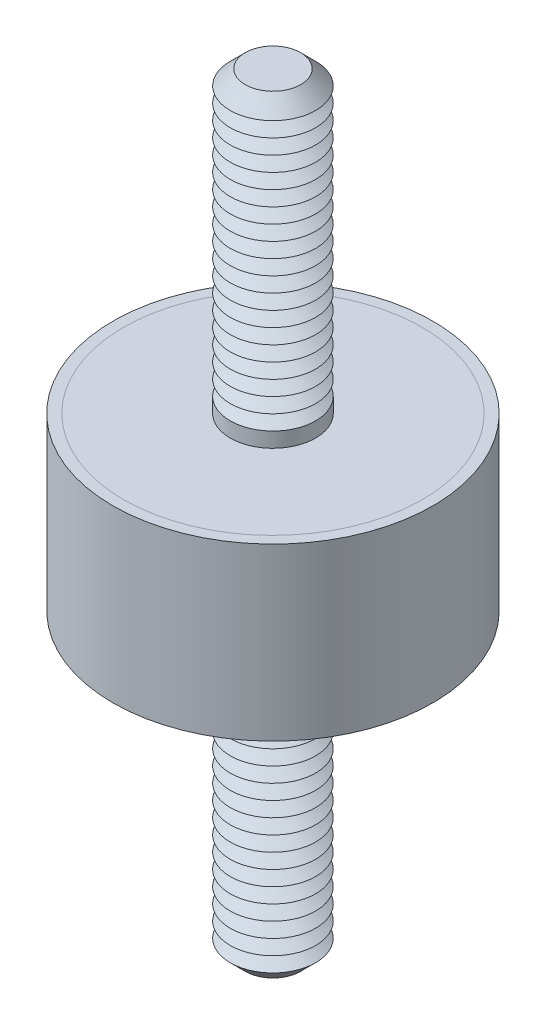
ISO-10303-21;
HEADER;
FILE_DESCRIPTION(('STEP AP214'),'2;1');
FILE_NAME('part.step','',(''),(''),'','','');
FILE_SCHEMA(('AUTOMOTIVE_DESIGN { 1 0 10303 214 1 1 1 1 }'));
ENDSEC;
DATA;
#1=APPLICATION_CONTEXT('core data for automotive mechanical design processes');
#2=APPLICATION_PROTOCOL_DEFINITION('international standard','automotive_design',2000,#1);
#3=PRODUCT_CONTEXT('',#1,'mechanical');
#4=PRODUCT('Part','Part','',(#3));
#5=PRODUCT_RELATED_PRODUCT_CATEGORY('part','',(#4));
#6=PRODUCT_DEFINITION_FORMATION('','',#4);
#7=PRODUCT_DEFINITION_CONTEXT('part definition',#1,'design');
#8=PRODUCT_DEFINITION('design','',#6,#7);
#9=PRODUCT_DEFINITION_SHAPE('','',#8);
#10=(LENGTH_UNIT() NAMED_UNIT(*) SI_UNIT(.MILLI.,.METRE.));
#11=(NAMED_UNIT(*) PLANE_ANGLE_UNIT() SI_UNIT($,.RADIAN.));
#12=(NAMED_UNIT(*) SI_UNIT($,.STERADIAN.) SOLID_ANGLE_UNIT());
#13=UNCERTAINTY_MEASURE_WITH_UNIT(LENGTH_MEASURE(1.E-05),#10,'distance_accuracy_value','');
#14=(GEOMETRIC_REPRESENTATION_CONTEXT(3) GLOBAL_UNCERTAINTY_ASSIGNED_CONTEXT((#13)) GLOBAL_UNIT_ASSIGNED_CONTEXT((#10,
#11,#12)) REPRESENTATION_CONTEXT('',''));
#15=CARTESIAN_POINT('',(0.,0.,0.));
#16=DIRECTION('',(0.,0.,1.));
#17=DIRECTION('',(1.,0.,0.));
#18=AXIS2_PLACEMENT_3D('',#15,#16,#17);
#19=CARTESIAN_POINT('',(0.,-18.,0.));
#20=DIRECTION('',(0.,1.,0.));
#21=DIRECTION('',(0.,0.,1.));
#22=AXIS2_PLACEMENT_3D('',#19,#20,#21);
#23=CYLINDRICAL_SURFACE('',#22,2.);
#24=CARTESIAN_POINT('',(0.,-4.,0.));
#25=DIRECTION('',(0.,-1.,0.));
#26=DIRECTION('',(0.,0.,-1.));
#27=AXIS2_PLACEMENT_3D('',#24,#25,#26);
#28=CIRCLE('',#27,2.);
#29=CARTESIAN_POINT('',(0.,-4.,-2.));
#30=VERTEX_POINT('',#29);
#31=EDGE_CURVE('P0_E21',#30,#30,#28,.T.);
#32=ORIENTED_EDGE('',*,*,#31,.T.);
#33=EDGE_LOOP('',(#32));
#34=FACE_BOUND('',#33,.T.);
#35=CARTESIAN_POINT('',(0.,-4.7,0.));
#36=DIRECTION('',(0.,1.,0.));
#37=DIRECTION('',(0.,0.,1.));
#38=AXIS2_PLACEMENT_3D('',#35,#36,#37);
#39=CIRCLE('',#38,2.);
#40=CARTESIAN_POINT('',(0.,-4.7,2.));
#41=VERTEX_POINT('',#40);
#42=EDGE_CURVE('P0_E33',#41,#41,#39,.T.);
#43=ORIENTED_EDGE('',*,*,#42,.T.);
#44=EDGE_LOOP('',(#43));
#45=FACE_BOUND('',#44,.T.);
#46=ADVANCED_FACE('P0_F14',(#34,#45),#23,.T.);
#47=CARTESIAN_POINT('',(0.,-4.,0.));
#48=DIRECTION('',(0.,1.,0.));
#49=DIRECTION('',(0.,0.,1.));
#50=AXIS2_PLACEMENT_3D('',#47,#48,#49);
#51=CYLINDRICAL_SURFACE('',#50,7.);
#52=CARTESIAN_POINT('',(0.,-4.,0.));
#53=DIRECTION('',(0.,1.,0.));
#54=DIRECTION('',(0.,0.,1.));
#55=AXIS2_PLACEMENT_3D('',#52,#53,#54);
#56=CIRCLE('',#55,7.);
#57=CARTESIAN_POINT('',(0.,-4.,7.));
#58=VERTEX_POINT('',#57);
#59=EDGE_CURVE('P0_E25',#58,#58,#56,.T.);
#60=ORIENTED_EDGE('',*,*,#59,.T.);
#61=EDGE_LOOP('',(#60));
#62=FACE_BOUND('',#61,.T.);
#63=CARTESIAN_POINT('',(0.,-3.5,0.));
#64=DIRECTION('',(0.,1.,0.));
#65=DIRECTION('',(0.,0.,1.));
#66=AXIS2_PLACEMENT_3D('',#63,#64,#65);
#67=CIRCLE('',#66,7.);
#68=CARTESIAN_POINT('',(0.,-3.5,7.));
#69=VERTEX_POINT('',#68);
#70=EDGE_CURVE('P0_E30',#69,#69,#67,.T.);
#71=ORIENTED_EDGE('',*,*,#70,.F.);
#72=EDGE_LOOP('',(#71));
#73=FACE_BOUND('',#72,.T.);
#74=ADVANCED_FACE('P0_F169',(#62,#73),#51,.T.);
#75=CARTESIAN_POINT('',(0.,-4.,0.));
#76=DIRECTION('',(0.,1.,0.));
#77=DIRECTION('',(0.,0.,1.));
#78=AXIS2_PLACEMENT_3D('',#75,#76,#77);
#79=PLANE('',#78);
#80=ORIENTED_EDGE('',*,*,#31,.F.);
#81=EDGE_LOOP('',(#80));
#82=FACE_BOUND('',#81,.T.);
#83=ORIENTED_EDGE('',*,*,#59,.F.);
#84=EDGE_LOOP('',(#83));
#85=FACE_BOUND('',#84,.T.);
#86=ADVANCED_FACE('P0_F174',(#82,#85),#79,.F.);
#87=CARTESIAN_POINT('',(0.,-3.5,0.));
#88=DIRECTION('',(0.,1.,0.));
#89=DIRECTION('',(0.,0.,1.));
#90=AXIS2_PLACEMENT_3D('',#87,#88,#89);
#91=PLANE('',#90);
#92=ORIENTED_EDGE('',*,*,#70,.T.);
#93=EDGE_LOOP('',(#92));
#94=FACE_BOUND('',#93,.T.);
#95=ADVANCED_FACE('P0_F180',(#94),#91,.T.);
#96=CARTESIAN_POINT('',(0.,-4.7,0.));
#97=DIRECTION('',(0.,1.,0.));
#98=DIRECTION('',(0.,0.,1.));
#99=AXIS2_PLACEMENT_3D('',#96,#97,#98);
#100=CONICAL_SURFACE('',#99,2.,1.0471975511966);
#101=CARTESIAN_POINT('',(0.,-5.05,0.));
#102=DIRECTION('',(0.,1.,0.));
#103=DIRECTION('',(0.,0.,1.));
#104=AXIS2_PLACEMENT_3D('',#101,#102,#103);
#105=CIRCLE('',#104,1.39378221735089);
#106=CARTESIAN_POINT('',(0.,-5.05,1.39378221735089));
#107=VERTEX_POINT('',#106);
#108=EDGE_CURVE('P0_E39',#107,#107,#105,.T.);
#109=ORIENTED_EDGE('',*,*,#108,.T.);
#110=EDGE_LOOP('',(#109));
#111=FACE_BOUND('',#110,.T.);
#112=ORIENTED_EDGE('',*,*,#42,.F.);
#113=EDGE_LOOP('',(#112));
#114=FACE_BOUND('',#113,.T.);
#115=ADVANCED_FACE('P0_F183',(#111,#114),#100,.T.);
#116=CARTESIAN_POINT('',(0.,-5.05,0.));
#117=DIRECTION('',(0.,-1.,0.));
#118=DIRECTION('',(0.,0.,-1.));
#119=AXIS2_PLACEMENT_3D('',#116,#117,#118);
#120=CONICAL_SURFACE('',#119,1.39378221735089,1.0471975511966);
#121=CARTESIAN_POINT('',(0.,-5.4,0.));
#122=DIRECTION('',(0.,1.,0.));
#123=DIRECTION('',(0.,0.,1.));
#124=AXIS2_PLACEMENT_3D('',#121,#122,#123);
#125=CIRCLE('',#124,2.);
#126=CARTESIAN_POINT('',(0.,-5.4,2.));
#127=VERTEX_POINT('',#126);
#128=EDGE_CURVE('P0_E43',#127,#127,#125,.T.);
#129=ORIENTED_EDGE('',*,*,#128,.T.);
#130=EDGE_LOOP('',(#129));
#131=FACE_BOUND('',#130,.T.);
#132=ORIENTED_EDGE('',*,*,#108,.F.);
#133=EDGE_LOOP('',(#132));
#134=FACE_BOUND('',#133,.T.);
#135=ADVANCED_FACE('P0_F187',(#131,#134),#120,.T.);
#136=CARTESIAN_POINT('',(0.,-5.4,0.));
#137=DIRECTION('',(0.,1.,0.));
#138=DIRECTION('',(0.,0.,1.));
#139=AXIS2_PLACEMENT_3D('',#136,#137,#138);
#140=CONICAL_SURFACE('',#139,2.,1.0471975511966);
#141=CARTESIAN_POINT('',(0.,-5.75,0.));
#142=DIRECTION('',(0.,1.,0.));
#143=DIRECTION('',(0.,0.,1.));
#144=AXIS2_PLACEMENT_3D('',#141,#142,#143);
#145=CIRCLE('',#144,1.39378221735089);
#146=CARTESIAN_POINT('',(0.,-5.75,1.39378221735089));
#147=VERTEX_POINT('',#146);
#148=EDGE_CURVE('P0_E47',#147,#147,#145,.T.);
#149=ORIENTED_EDGE('',*,*,#148,.T.);
#150=EDGE_LOOP('',(#149));
#151=FACE_BOUND('',#150,.T.);
#152=ORIENTED_EDGE('',*,*,#128,.F.);
#153=EDGE_LOOP('',(#152));
#154=FACE_BOUND('',#153,.T.);
#155=ADVANCED_FACE('P0_F191',(#151,#154),#140,.T.);
#156=CARTESIAN_POINT('',(0.,-5.75,0.));
#157=DIRECTION('',(0.,-1.,0.));
#158=DIRECTION('',(0.,0.,-1.));
#159=AXIS2_PLACEMENT_3D('',#156,#157,#158);
#160=CONICAL_SURFACE('',#159,1.39378221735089,1.0471975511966);
#161=CARTESIAN_POINT('',(0.,-6.1,0.));
#162=DIRECTION('',(0.,1.,0.));
#163=DIRECTION('',(0.,0.,1.));
#164=AXIS2_PLACEMENT_3D('',#161,#162,#163);
#165=CIRCLE('',#164,2.);
#166=CARTESIAN_POINT('',(0.,-6.1,2.));
#167=VERTEX_POINT('',#166);
#168=EDGE_CURVE('P0_E52',#167,#167,#165,.T.);
#169=ORIENTED_EDGE('',*,*,#168,.T.);
#170=EDGE_LOOP('',(#169));
#171=FACE_BOUND('',#170,.T.);
#172=ORIENTED_EDGE('',*,*,#148,.F.);
#173=EDGE_LOOP('',(#172));
#174=FACE_BOUND('',#173,.T.);
#175=ADVANCED_FACE('P0_F198',(#171,#174),#160,.T.);
#176=CARTESIAN_POINT('',(0.,-6.1,0.));
#177=DIRECTION('',(0.,1.,0.));
#178=DIRECTION('',(0.,0.,1.));
#179=AXIS2_PLACEMENT_3D('',#176,#177,#178);
#180=CONICAL_SURFACE('',#179,2.,1.0471975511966);
#181=CARTESIAN_POINT('',(0.,-6.45,0.));
#182=DIRECTION('',(0.,1.,0.));
#183=DIRECTION('',(0.,0.,1.));
#184=AXIS2_PLACEMENT_3D('',#181,#182,#183);
#185=CIRCLE('',#184,1.39378221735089);
#186=CARTESIAN_POINT('',(0.,-6.45,1.39378221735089));
#187=VERTEX_POINT('',#186);
#188=EDGE_CURVE('P0_E55',#187,#187,#185,.T.);
#189=ORIENTED_EDGE('',*,*,#188,.T.);
#190=EDGE_LOOP('',(#189));
#191=FACE_BOUND('',#190,.T.);
#192=ORIENTED_EDGE('',*,*,#168,.F.);
#193=EDGE_LOOP('',(#192));
#194=FACE_BOUND('',#193,.T.);
#195=ADVANCED_FACE('P0_F202',(#191,#194),#180,.T.);
#196=CARTESIAN_POINT('',(0.,-6.45,0.));
#197=DIRECTION('',(0.,-1.,0.));
#198=DIRECTION('',(0.,0.,-1.));
#199=AXIS2_PLACEMENT_3D('',#196,#197,#198);
#200=CONICAL_SURFACE('',#199,1.39378221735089,1.0471975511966);
#201=CARTESIAN_POINT('',(0.,-6.8,0.));
#202=DIRECTION('',(0.,1.,0.));
#203=DIRECTION('',(0.,0.,1.));
#204=AXIS2_PLACEMENT_3D('',#201,#202,#203);
#205=CIRCLE('',#204,2.);
#206=CARTESIAN_POINT('',(0.,-6.8,2.));
#207=VERTEX_POINT('',#206);
#208=EDGE_CURVE('P0_E58',#207,#207,#205,.T.);
#209=ORIENTED_EDGE('',*,*,#208,.T.);
#210=EDGE_LOOP('',(#209));
#211=FACE_BOUND('',#210,.T.);
#212=ORIENTED_EDGE('',*,*,#188,.F.);
#213=EDGE_LOOP('',(#212));
#214=FACE_BOUND('',#213,.T.);
#215=ADVANCED_FACE('P0_F206',(#211,#214),#200,.T.);
#216=CARTESIAN_POINT('',(0.,-6.8,0.));
#217=DIRECTION('',(0.,1.,0.));
#218=DIRECTION('',(0.,0.,1.));
#219=AXIS2_PLACEMENT_3D('',#216,#217,#218);
#220=CONICAL_SURFACE('',#219,2.,1.0471975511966);
#221=CARTESIAN_POINT('',(0.,-7.15,0.));
#222=DIRECTION('',(0.,1.,0.));
#223=DIRECTION('',(0.,0.,1.));
#224=AXIS2_PLACEMENT_3D('',#221,#222,#223);
#225=CIRCLE('',#224,1.39378221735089);
#226=CARTESIAN_POINT('',(0.,-7.15,1.39378221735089));
#227=VERTEX_POINT('',#226);
#228=EDGE_CURVE('P0_E61',#227,#227,#225,.T.);
#229=ORIENTED_EDGE('',*,*,#228,.T.);
#230=EDGE_LOOP('',(#229));
#231=FACE_BOUND('',#230,.T.);
#232=ORIENTED_EDGE('',*,*,#208,.F.);
#233=EDGE_LOOP('',(#232));
#234=FACE_BOUND('',#233,.T.);
#235=ADVANCED_FACE('P0_F210',(#231,#234),#220,.T.);
#236=CARTESIAN_POINT('',(0.,-7.15,0.));
#237=DIRECTION('',(0.,-1.,0.));
#238=DIRECTION('',(0.,0.,-1.));
#239=AXIS2_PLACEMENT_3D('',#236,#237,#238);
#240=CONICAL_SURFACE('',#239,1.39378221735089,1.0471975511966);
#241=CARTESIAN_POINT('',(0.,-7.5,0.));
#242=DIRECTION('',(0.,1.,0.));
#243=DIRECTION('',(0.,0.,1.));
#244=AXIS2_PLACEMENT_3D('',#241,#242,#243);
#245=CIRCLE('',#244,2.);
#246=CARTESIAN_POINT('',(0.,-7.5,2.));
#247=VERTEX_POINT('',#246);
#248=EDGE_CURVE('P0_E64',#247,#247,#245,.T.);
#249=ORIENTED_EDGE('',*,*,#248,.T.);
#250=EDGE_LOOP('',(#249));
#251=FACE_BOUND('',#250,.T.);
#252=ORIENTED_EDGE('',*,*,#228,.F.);
#253=EDGE_LOOP('',(#252));
#254=FACE_BOUND('',#253,.T.);
#255=ADVANCED_FACE('P0_F214',(#251,#254),#240,.T.);
#256=CARTESIAN_POINT('',(0.,-7.5,0.));
#257=DIRECTION('',(0.,1.,0.));
#258=DIRECTION('',(0.,0.,1.));
#259=AXIS2_PLACEMENT_3D('',#256,#257,#258);
#260=CONICAL_SURFACE('',#259,2.,1.0471975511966);
#261=CARTESIAN_POINT('',(0.,-7.85,0.));
#262=DIRECTION('',(0.,1.,0.));
#263=DIRECTION('',(0.,0.,1.));
#264=AXIS2_PLACEMENT_3D('',#261,#262,#263);
#265=CIRCLE('',#264,1.39378221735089);
#266=CARTESIAN_POINT('',(0.,-7.85,1.39378221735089));
#267=VERTEX_POINT('',#266);
#268=EDGE_CURVE('P0_E67',#267,#267,#265,.T.);
#269=ORIENTED_EDGE('',*,*,#268,.T.);
#270=EDGE_LOOP('',(#269));
#271=FACE_BOUND('',#270,.T.);
#272=ORIENTED_EDGE('',*,*,#248,.F.);
#273=EDGE_LOOP('',(#272));
#274=FACE_BOUND('',#273,.T.);
#275=ADVANCED_FACE('P0_F218',(#271,#274),#260,.T.);
#276=CARTESIAN_POINT('',(0.,-7.85,0.));
#277=DIRECTION('',(0.,-1.,0.));
#278=DIRECTION('',(0.,0.,-1.));
#279=AXIS2_PLACEMENT_3D('',#276,#277,#278);
#280=CONICAL_SURFACE('',#279,1.39378221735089,1.0471975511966);
#281=CARTESIAN_POINT('',(0.,-8.2,0.));
#282=DIRECTION('',(0.,1.,0.));
#283=DIRECTION('',(0.,0.,1.));
#284=AXIS2_PLACEMENT_3D('',#281,#282,#283);
#285=CIRCLE('',#284,2.);
#286=CARTESIAN_POINT('',(0.,-8.2,2.));
#287=VERTEX_POINT('',#286);
#288=EDGE_CURVE('P0_E70',#287,#287,#285,.T.);
#289=ORIENTED_EDGE('',*,*,#288,.T.);
#290=EDGE_LOOP('',(#289));
#291=FACE_BOUND('',#290,.T.);
#292=ORIENTED_EDGE('',*,*,#268,.F.);
#293=EDGE_LOOP('',(#292));
#294=FACE_BOUND('',#293,.T.);
#295=ADVANCED_FACE('P0_F222',(#291,#294),#280,.T.);
#296=CARTESIAN_POINT('',(0.,-8.2,0.));
#297=DIRECTION('',(0.,1.,0.));
#298=DIRECTION('',(0.,0.,1.));
#299=AXIS2_PLACEMENT_3D('',#296,#297,#298);
#300=CONICAL_SURFACE('',#299,2.,1.0471975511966);
#301=CARTESIAN_POINT('',(0.,-8.55,0.));
#302=DIRECTION('',(0.,1.,0.));
#303=DIRECTION('',(0.,0.,1.));
#304=AXIS2_PLACEMENT_3D('',#301,#302,#303);
#305=CIRCLE('',#304,1.39378221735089);
#306=CARTESIAN_POINT('',(0.,-8.55,1.39378221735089));
#307=VERTEX_POINT('',#306);
#308=EDGE_CURVE('P0_E73',#307,#307,#305,.T.);
#309=ORIENTED_EDGE('',*,*,#308,.T.);
#310=EDGE_LOOP('',(#309));
#311=FACE_BOUND('',#310,.T.);
#312=ORIENTED_EDGE('',*,*,#288,.F.);
#313=EDGE_LOOP('',(#312));
#314=FACE_BOUND('',#313,.T.);
#315=ADVANCED_FACE('P0_F226',(#311,#314),#300,.T.);
#316=CARTESIAN_POINT('',(0.,-8.55,0.));
#317=DIRECTION('',(0.,-1.,0.));
#318=DIRECTION('',(0.,0.,-1.));
#319=AXIS2_PLACEMENT_3D('',#316,#317,#318);
#320=CONICAL_SURFACE('',#319,1.39378221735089,1.0471975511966);
#321=CARTESIAN_POINT('',(0.,-8.9,0.));
#322=DIRECTION('',(0.,1.,0.));
#323=DIRECTION('',(0.,0.,1.));
#324=AXIS2_PLACEMENT_3D('',#321,#322,#323);
#325=CIRCLE('',#324,2.);
#326=CARTESIAN_POINT('',(0.,-8.9,2.));
#327=VERTEX_POINT('',#326);
#328=EDGE_CURVE('P0_E76',#327,#327,#325,.T.);
#329=ORIENTED_EDGE('',*,*,#328,.T.);
#330=EDGE_LOOP('',(#329));
#331=FACE_BOUND('',#330,.T.);
#332=ORIENTED_EDGE('',*,*,#308,.F.);
#333=EDGE_LOOP('',(#332));
#334=FACE_BOUND('',#333,.T.);
#335=ADVANCED_FACE('P0_F230',(#331,#334),#320,.T.);
#336=CARTESIAN_POINT('',(0.,-8.9,0.));
#337=DIRECTION('',(0.,1.,0.));
#338=DIRECTION('',(0.,0.,1.));
#339=AXIS2_PLACEMENT_3D('',#336,#337,#338);
#340=CONICAL_SURFACE('',#339,2.,1.0471975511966);
#341=CARTESIAN_POINT('',(0.,-9.25,0.));
#342=DIRECTION('',(0.,1.,0.));
#343=DIRECTION('',(0.,0.,1.));
#344=AXIS2_PLACEMENT_3D('',#341,#342,#343);
#345=CIRCLE('',#344,1.39378221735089);
#346=CARTESIAN_POINT('',(0.,-9.25,1.39378221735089));
#347=VERTEX_POINT('',#346);
#348=EDGE_CURVE('P0_E79',#347,#347,#345,.T.);
#349=ORIENTED_EDGE('',*,*,#348,.T.);
#350=EDGE_LOOP('',(#349));
#351=FACE_BOUND('',#350,.T.);
#352=ORIENTED_EDGE('',*,*,#328,.F.);
#353=EDGE_LOOP('',(#352));
#354=FACE_BOUND('',#353,.T.);
#355=ADVANCED_FACE('P0_F234',(#351,#354),#340,.T.);
#356=CARTESIAN_POINT('',(0.,-9.25,0.));
#357=DIRECTION('',(0.,-1.,0.));
#358=DIRECTION('',(0.,0.,-1.));
#359=AXIS2_PLACEMENT_3D('',#356,#357,#358);
#360=CONICAL_SURFACE('',#359,1.39378221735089,1.0471975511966);
#361=CARTESIAN_POINT('',(0.,-9.6,0.));
#362=DIRECTION('',(0.,1.,0.));
#363=DIRECTION('',(0.,0.,1.));
#364=AXIS2_PLACEMENT_3D('',#361,#362,#363);
#365=CIRCLE('',#364,2.);
#366=CARTESIAN_POINT('',(0.,-9.6,2.));
#367=VERTEX_POINT('',#366);
#368=EDGE_CURVE('P0_E82',#367,#367,#365,.T.);
#369=ORIENTED_EDGE('',*,*,#368,.T.);
#370=EDGE_LOOP('',(#369));
#371=FACE_BOUND('',#370,.T.);
#372=ORIENTED_EDGE('',*,*,#348,.F.);
#373=EDGE_LOOP('',(#372));
#374=FACE_BOUND('',#373,.T.);
#375=ADVANCED_FACE('P0_F238',(#371,#374),#360,.T.);
#376=CARTESIAN_POINT('',(0.,-9.6,0.));
#377=DIRECTION('',(0.,1.,0.));
#378=DIRECTION('',(0.,0.,1.));
#379=AXIS2_PLACEMENT_3D('',#376,#377,#378);
#380=CONICAL_SURFACE('',#379,2.,1.0471975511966);
#381=CARTESIAN_POINT('',(0.,-9.95,0.));
#382=DIRECTION('',(0.,1.,0.));
#383=DIRECTION('',(0.,0.,1.));
#384=AXIS2_PLACEMENT_3D('',#381,#382,#383);
#385=CIRCLE('',#384,1.39378221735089);
#386=CARTESIAN_POINT('',(0.,-9.95,1.39378221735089));
#387=VERTEX_POINT('',#386);
#388=EDGE_CURVE('P0_E85',#387,#387,#385,.T.);
#389=ORIENTED_EDGE('',*,*,#388,.T.);
#390=EDGE_LOOP('',(#389));
#391=FACE_BOUND('',#390,.T.);
#392=ORIENTED_EDGE('',*,*,#368,.F.);
#393=EDGE_LOOP('',(#392));
#394=FACE_BOUND('',#393,.T.);
#395=ADVANCED_FACE('P0_F242',(#391,#394),#380,.T.);
#396=CARTESIAN_POINT('',(0.,-9.95,0.));
#397=DIRECTION('',(0.,-1.,0.));
#398=DIRECTION('',(0.,0.,-1.));
#399=AXIS2_PLACEMENT_3D('',#396,#397,#398);
#400=CONICAL_SURFACE('',#399,1.39378221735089,1.0471975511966);
#401=CARTESIAN_POINT('',(0.,-10.3,0.));
#402=DIRECTION('',(0.,1.,0.));
#403=DIRECTION('',(0.,0.,1.));
#404=AXIS2_PLACEMENT_3D('',#401,#402,#403);
#405=CIRCLE('',#404,2.);
#406=CARTESIAN_POINT('',(0.,-10.3,2.));
#407=VERTEX_POINT('',#406);
#408=EDGE_CURVE('P0_E88',#407,#407,#405,.T.);
#409=ORIENTED_EDGE('',*,*,#408,.T.);
#410=EDGE_LOOP('',(#409));
#411=FACE_BOUND('',#410,.T.);
#412=ORIENTED_EDGE('',*,*,#388,.F.);
#413=EDGE_LOOP('',(#412));
#414=FACE_BOUND('',#413,.T.);
#415=ADVANCED_FACE('P0_F246',(#411,#414),#400,.T.);
#416=CARTESIAN_POINT('',(0.,-10.3,0.));
#417=DIRECTION('',(0.,1.,0.));
#418=DIRECTION('',(0.,0.,1.));
#419=AXIS2_PLACEMENT_3D('',#416,#417,#418);
#420=CONICAL_SURFACE('',#419,2.,1.0471975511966);
#421=CARTESIAN_POINT('',(0.,-10.65,0.));
#422=DIRECTION('',(0.,1.,0.));
#423=DIRECTION('',(0.,0.,1.));
#424=AXIS2_PLACEMENT_3D('',#421,#422,#423);
#425=CIRCLE('',#424,1.39378221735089);
#426=CARTESIAN_POINT('',(0.,-10.65,1.39378221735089));
#427=VERTEX_POINT('',#426);
#428=EDGE_CURVE('P0_E91',#427,#427,#425,.T.);
#429=ORIENTED_EDGE('',*,*,#428,.T.);
#430=EDGE_LOOP('',(#429));
#431=FACE_BOUND('',#430,.T.);
#432=ORIENTED_EDGE('',*,*,#408,.F.);
#433=EDGE_LOOP('',(#432));
#434=FACE_BOUND('',#433,.T.);
#435=ADVANCED_FACE('P0_F250',(#431,#434),#420,.T.);
#436=CARTESIAN_POINT('',(0.,-10.65,0.));
#437=DIRECTION('',(0.,-1.,0.));
#438=DIRECTION('',(0.,0.,-1.));
#439=AXIS2_PLACEMENT_3D('',#436,#437,#438);
#440=CONICAL_SURFACE('',#439,1.39378221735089,1.0471975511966);
#441=CARTESIAN_POINT('',(0.,-11.,0.));
#442=DIRECTION('',(0.,1.,0.));
#443=DIRECTION('',(0.,0.,1.));
#444=AXIS2_PLACEMENT_3D('',#441,#442,#443);
#445=CIRCLE('',#444,2.);
#446=CARTESIAN_POINT('',(0.,-11.,2.));
#447=VERTEX_POINT('',#446);
#448=EDGE_CURVE('P0_E94',#447,#447,#445,.T.);
#449=ORIENTED_EDGE('',*,*,#448,.T.);
#450=EDGE_LOOP('',(#449));
#451=FACE_BOUND('',#450,.T.);
#452=ORIENTED_EDGE('',*,*,#428,.F.);
#453=EDGE_LOOP('',(#452));
#454=FACE_BOUND('',#453,.T.);
#455=ADVANCED_FACE('P0_F254',(#451,#454),#440,.T.);
#456=CARTESIAN_POINT('',(0.,-11.,0.));
#457=DIRECTION('',(0.,1.,0.));
#458=DIRECTION('',(0.,0.,1.));
#459=AXIS2_PLACEMENT_3D('',#456,#457,#458);
#460=CONICAL_SURFACE('',#459,2.,1.0471975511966);
#461=CARTESIAN_POINT('',(0.,-11.35,0.));
#462=DIRECTION('',(0.,1.,0.));
#463=DIRECTION('',(0.,0.,1.));
#464=AXIS2_PLACEMENT_3D('',#461,#462,#463);
#465=CIRCLE('',#464,1.39378221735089);
#466=CARTESIAN_POINT('',(0.,-11.35,1.39378221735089));
#467=VERTEX_POINT('',#466);
#468=EDGE_CURVE('P0_E97',#467,#467,#465,.T.);
#469=ORIENTED_EDGE('',*,*,#468,.T.);
#470=EDGE_LOOP('',(#469));
#471=FACE_BOUND('',#470,.T.);
#472=ORIENTED_EDGE('',*,*,#448,.F.);
#473=EDGE_LOOP('',(#472));
#474=FACE_BOUND('',#473,.T.);
#475=ADVANCED_FACE('P0_F258',(#471,#474),#460,.T.);
#476=CARTESIAN_POINT('',(0.,-11.35,0.));
#477=DIRECTION('',(0.,-1.,0.));
#478=DIRECTION('',(0.,0.,-1.));
#479=AXIS2_PLACEMENT_3D('',#476,#477,#478);
#480=CONICAL_SURFACE('',#479,1.39378221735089,1.0471975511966);
#481=CARTESIAN_POINT('',(0.,-11.7,0.));
#482=DIRECTION('',(0.,1.,0.));
#483=DIRECTION('',(0.,0.,1.));
#484=AXIS2_PLACEMENT_3D('',#481,#482,#483);
#485=CIRCLE('',#484,2.);
#486=CARTESIAN_POINT('',(0.,-11.7,2.));
#487=VERTEX_POINT('',#486);
#488=EDGE_CURVE('P0_E100',#487,#487,#485,.T.);
#489=ORIENTED_EDGE('',*,*,#488,.T.);
#490=EDGE_LOOP('',(#489));
#491=FACE_BOUND('',#490,.T.);
#492=ORIENTED_EDGE('',*,*,#468,.F.);
#493=EDGE_LOOP('',(#492));
#494=FACE_BOUND('',#493,.T.);
#495=ADVANCED_FACE('P0_F262',(#491,#494),#480,.T.);
#496=CARTESIAN_POINT('',(0.,-11.7,0.));
#497=DIRECTION('',(0.,1.,0.));
#498=DIRECTION('',(0.,0.,1.));
#499=AXIS2_PLACEMENT_3D('',#496,#497,#498);
#500=CONICAL_SURFACE('',#499,2.,1.0471975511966);
#501=CARTESIAN_POINT('',(0.,-12.05,0.));
#502=DIRECTION('',(0.,1.,0.));
#503=DIRECTION('',(0.,0.,1.));
#504=AXIS2_PLACEMENT_3D('',#501,#502,#503);
#505=CIRCLE('',#504,1.39378221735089);
#506=CARTESIAN_POINT('',(0.,-12.05,1.39378221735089));
#507=VERTEX_POINT('',#506);
#508=EDGE_CURVE('P0_E103',#507,#507,#505,.T.);
#509=ORIENTED_EDGE('',*,*,#508,.T.);
#510=EDGE_LOOP('',(#509));
#511=FACE_BOUND('',#510,.T.);
#512=ORIENTED_EDGE('',*,*,#488,.F.);
#513=EDGE_LOOP('',(#512));
#514=FACE_BOUND('',#513,.T.);
#515=ADVANCED_FACE('P0_F266',(#511,#514),#500,.T.);
#516=CARTESIAN_POINT('',(0.,-12.05,0.));
#517=DIRECTION('',(0.,-1.,0.));
#518=DIRECTION('',(0.,0.,-1.));
#519=AXIS2_PLACEMENT_3D('',#516,#517,#518);
#520=CONICAL_SURFACE('',#519,1.39378221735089,1.0471975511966);
#521=CARTESIAN_POINT('',(0.,-12.4,0.));
#522=DIRECTION('',(0.,1.,0.));
#523=DIRECTION('',(0.,0.,1.));
#524=AXIS2_PLACEMENT_3D('',#521,#522,#523);
#525=CIRCLE('',#524,2.);
#526=CARTESIAN_POINT('',(0.,-12.4,2.));
#527=VERTEX_POINT('',#526);
#528=EDGE_CURVE('P0_E106',#527,#527,#525,.T.);
#529=ORIENTED_EDGE('',*,*,#528,.T.);
#530=EDGE_LOOP('',(#529));
#531=FACE_BOUND('',#530,.T.);
#532=ORIENTED_EDGE('',*,*,#508,.F.);
#533=EDGE_LOOP('',(#532));
#534=FACE_BOUND('',#533,.T.);
#535=ADVANCED_FACE('P0_F270',(#531,#534),#520,.T.);
#536=CARTESIAN_POINT('',(0.,-12.4,0.));
#537=DIRECTION('',(0.,1.,0.));
#538=DIRECTION('',(0.,0.,1.));
#539=AXIS2_PLACEMENT_3D('',#536,#537,#538);
#540=CONICAL_SURFACE('',#539,2.,1.0471975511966);
#541=CARTESIAN_POINT('',(0.,-12.75,0.));
#542=DIRECTION('',(0.,1.,0.));
#543=DIRECTION('',(0.,0.,1.));
#544=AXIS2_PLACEMENT_3D('',#541,#542,#543);
#545=CIRCLE('',#544,1.39378221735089);
#546=CARTESIAN_POINT('',(0.,-12.75,1.39378221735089));
#547=VERTEX_POINT('',#546);
#548=EDGE_CURVE('P0_E109',#547,#547,#545,.T.);
#549=ORIENTED_EDGE('',*,*,#548,.T.);
#550=EDGE_LOOP('',(#549));
#551=FACE_BOUND('',#550,.T.);
#552=ORIENTED_EDGE('',*,*,#528,.F.);
#553=EDGE_LOOP('',(#552));
#554=FACE_BOUND('',#553,.T.);
#555=ADVANCED_FACE('P0_F274',(#551,#554),#540,.T.);
#556=CARTESIAN_POINT('',(0.,-12.75,0.));
#557=DIRECTION('',(0.,-1.,0.));
#558=DIRECTION('',(0.,0.,-1.));
#559=AXIS2_PLACEMENT_3D('',#556,#557,#558);
#560=CONICAL_SURFACE('',#559,1.39378221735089,1.0471975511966);
#561=CARTESIAN_POINT('',(0.,-13.1,0.));
#562=DIRECTION('',(0.,1.,0.));
#563=DIRECTION('',(0.,0.,1.));
#564=AXIS2_PLACEMENT_3D('',#561,#562,#563);
#565=CIRCLE('',#564,2.);
#566=CARTESIAN_POINT('',(0.,-13.1,2.));
#567=VERTEX_POINT('',#566);
#568=EDGE_CURVE('P0_E112',#567,#567,#565,.T.);
#569=ORIENTED_EDGE('',*,*,#568,.T.);
#570=EDGE_LOOP('',(#569));
#571=FACE_BOUND('',#570,.T.);
#572=ORIENTED_EDGE('',*,*,#548,.F.);
#573=EDGE_LOOP('',(#572));
#574=FACE_BOUND('',#573,.T.);
#575=ADVANCED_FACE('P0_F278',(#571,#574),#560,.T.);
#576=CARTESIAN_POINT('',(0.,-13.1,0.));
#577=DIRECTION('',(0.,1.,0.));
#578=DIRECTION('',(0.,0.,1.));
#579=AXIS2_PLACEMENT_3D('',#576,#577,#578);
#580=CONICAL_SURFACE('',#579,2.,1.0471975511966);
#581=CARTESIAN_POINT('',(0.,-13.45,0.));
#582=DIRECTION('',(0.,1.,0.));
#583=DIRECTION('',(0.,0.,1.));
#584=AXIS2_PLACEMENT_3D('',#581,#582,#583);
#585=CIRCLE('',#584,1.39378221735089);
#586=CARTESIAN_POINT('',(0.,-13.45,1.39378221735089));
#587=VERTEX_POINT('',#586);
#588=EDGE_CURVE('P0_E115',#587,#587,#585,.T.);
#589=ORIENTED_EDGE('',*,*,#588,.T.);
#590=EDGE_LOOP('',(#589));
#591=FACE_BOUND('',#590,.T.);
#592=ORIENTED_EDGE('',*,*,#568,.F.);
#593=EDGE_LOOP('',(#592));
#594=FACE_BOUND('',#593,.T.);
#595=ADVANCED_FACE('P0_F282',(#591,#594),#580,.T.);
#596=CARTESIAN_POINT('',(0.,-13.45,0.));
#597=DIRECTION('',(0.,-1.,0.));
#598=DIRECTION('',(0.,0.,-1.));
#599=AXIS2_PLACEMENT_3D('',#596,#597,#598);
#600=CONICAL_SURFACE('',#599,1.39378221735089,1.0471975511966);
#601=CARTESIAN_POINT('',(0.,-13.8,0.));
#602=DIRECTION('',(0.,1.,0.));
#603=DIRECTION('',(0.,0.,1.));
#604=AXIS2_PLACEMENT_3D('',#601,#602,#603);
#605=CIRCLE('',#604,2.);
#606=CARTESIAN_POINT('',(0.,-13.8,2.));
#607=VERTEX_POINT('',#606);
#608=EDGE_CURVE('P0_E118',#607,#607,#605,.T.);
#609=ORIENTED_EDGE('',*,*,#608,.T.);
#610=EDGE_LOOP('',(#609));
#611=FACE_BOUND('',#610,.T.);
#612=ORIENTED_EDGE('',*,*,#588,.F.);
#613=EDGE_LOOP('',(#612));
#614=FACE_BOUND('',#613,.T.);
#615=ADVANCED_FACE('P0_F286',(#611,#614),#600,.T.);
#616=CARTESIAN_POINT('',(0.,-13.8,0.));
#617=DIRECTION('',(0.,1.,0.));
#618=DIRECTION('',(0.,0.,1.));
#619=AXIS2_PLACEMENT_3D('',#616,#617,#618);
#620=CONICAL_SURFACE('',#619,2.,1.0471975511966);
#621=CARTESIAN_POINT('',(0.,-14.15,0.));
#622=DIRECTION('',(0.,1.,0.));
#623=DIRECTION('',(0.,0.,1.));
#624=AXIS2_PLACEMENT_3D('',#621,#622,#623);
#625=CIRCLE('',#624,1.39378221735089);
#626=CARTESIAN_POINT('',(0.,-14.15,1.39378221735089));
#627=VERTEX_POINT('',#626);
#628=EDGE_CURVE('P0_E121',#627,#627,#625,.T.);
#629=ORIENTED_EDGE('',*,*,#628,.T.);
#630=EDGE_LOOP('',(#629));
#631=FACE_BOUND('',#630,.T.);
#632=ORIENTED_EDGE('',*,*,#608,.F.);
#633=EDGE_LOOP('',(#632));
#634=FACE_BOUND('',#633,.T.);
#635=ADVANCED_FACE('P0_F290',(#631,#634),#620,.T.);
#636=CARTESIAN_POINT('',(0.,-14.15,0.));
#637=DIRECTION('',(0.,-1.,0.));
#638=DIRECTION('',(0.,0.,-1.));
#639=AXIS2_PLACEMENT_3D('',#636,#637,#638);
#640=CONICAL_SURFACE('',#639,1.39378221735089,1.0471975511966);
#641=CARTESIAN_POINT('',(0.,-14.5,0.));
#642=DIRECTION('',(0.,1.,0.));
#643=DIRECTION('',(0.,0.,1.));
#644=AXIS2_PLACEMENT_3D('',#641,#642,#643);
#645=CIRCLE('',#644,2.);
#646=CARTESIAN_POINT('',(0.,-14.5,2.));
#647=VERTEX_POINT('',#646);
#648=EDGE_CURVE('P0_E124',#647,#647,#645,.T.);
#649=ORIENTED_EDGE('',*,*,#648,.T.);
#650=EDGE_LOOP('',(#649));
#651=FACE_BOUND('',#650,.T.);
#652=ORIENTED_EDGE('',*,*,#628,.F.);
#653=EDGE_LOOP('',(#652));
#654=FACE_BOUND('',#653,.T.);
#655=ADVANCED_FACE('P0_F294',(#651,#654),#640,.T.);
#656=CARTESIAN_POINT('',(0.,-14.5,0.));
#657=DIRECTION('',(0.,1.,0.));
#658=DIRECTION('',(0.,0.,1.));
#659=AXIS2_PLACEMENT_3D('',#656,#657,#658);
#660=CONICAL_SURFACE('',#659,2.,1.0471975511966);
#661=CARTESIAN_POINT('',(0.,-14.85,0.));
#662=DIRECTION('',(0.,1.,0.));
#663=DIRECTION('',(0.,0.,1.));
#664=AXIS2_PLACEMENT_3D('',#661,#662,#663);
#665=CIRCLE('',#664,1.39378221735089);
#666=CARTESIAN_POINT('',(0.,-14.85,1.39378221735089));
#667=VERTEX_POINT('',#666);
#668=EDGE_CURVE('P0_E127',#667,#667,#665,.T.);
#669=ORIENTED_EDGE('',*,*,#668,.T.);
#670=EDGE_LOOP('',(#669));
#671=FACE_BOUND('',#670,.T.);
#672=ORIENTED_EDGE('',*,*,#648,.F.);
#673=EDGE_LOOP('',(#672));
#674=FACE_BOUND('',#673,.T.);
#675=ADVANCED_FACE('P0_F298',(#671,#674),#660,.T.);
#676=CARTESIAN_POINT('',(0.,-14.85,0.));
#677=DIRECTION('',(0.,-1.,0.));
#678=DIRECTION('',(0.,0.,-1.));
#679=AXIS2_PLACEMENT_3D('',#676,#677,#678);
#680=CONICAL_SURFACE('',#679,1.39378221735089,1.0471975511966);
#681=CARTESIAN_POINT('',(0.,-15.2,0.));
#682=DIRECTION('',(0.,1.,0.));
#683=DIRECTION('',(0.,0.,1.));
#684=AXIS2_PLACEMENT_3D('',#681,#682,#683);
#685=CIRCLE('',#684,2.);
#686=CARTESIAN_POINT('',(0.,-15.2,2.));
#687=VERTEX_POINT('',#686);
#688=EDGE_CURVE('P0_E130',#687,#687,#685,.T.);
#689=ORIENTED_EDGE('',*,*,#688,.T.);
#690=EDGE_LOOP('',(#689));
#691=FACE_BOUND('',#690,.T.);
#692=ORIENTED_EDGE('',*,*,#668,.F.);
#693=EDGE_LOOP('',(#692));
#694=FACE_BOUND('',#693,.T.);
#695=ADVANCED_FACE('P0_F302',(#691,#694),#680,.T.);
#696=CARTESIAN_POINT('',(0.,-15.2,0.));
#697=DIRECTION('',(0.,1.,0.));
#698=DIRECTION('',(0.,0.,1.));
#699=AXIS2_PLACEMENT_3D('',#696,#697,#698);
#700=CONICAL_SURFACE('',#699,2.,1.0471975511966);
#701=CARTESIAN_POINT('',(0.,-15.55,0.));
#702=DIRECTION('',(0.,1.,0.));
#703=DIRECTION('',(0.,0.,1.));
#704=AXIS2_PLACEMENT_3D('',#701,#702,#703);
#705=CIRCLE('',#704,1.39378221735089);
#706=CARTESIAN_POINT('',(0.,-15.55,1.39378221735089));
#707=VERTEX_POINT('',#706);
#708=EDGE_CURVE('P0_E133',#707,#707,#705,.T.);
#709=ORIENTED_EDGE('',*,*,#708,.T.);
#710=EDGE_LOOP('',(#709));
#711=FACE_BOUND('',#710,.T.);
#712=ORIENTED_EDGE('',*,*,#688,.F.);
#713=EDGE_LOOP('',(#712));
#714=FACE_BOUND('',#713,.T.);
#715=ADVANCED_FACE('P0_F306',(#711,#714),#700,.T.);
#716=CARTESIAN_POINT('',(0.,-15.55,0.));
#717=DIRECTION('',(0.,-1.,0.));
#718=DIRECTION('',(0.,0.,-1.));
#719=AXIS2_PLACEMENT_3D('',#716,#717,#718);
#720=CONICAL_SURFACE('',#719,1.39378221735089,1.0471975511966);
#721=CARTESIAN_POINT('',(0.,-15.9,0.));
#722=DIRECTION('',(0.,1.,0.));
#723=DIRECTION('',(0.,0.,1.));
#724=AXIS2_PLACEMENT_3D('',#721,#722,#723);
#725=CIRCLE('',#724,2.);
#726=CARTESIAN_POINT('',(0.,-15.9,2.));
#727=VERTEX_POINT('',#726);
#728=EDGE_CURVE('P0_E136',#727,#727,#725,.T.);
#729=ORIENTED_EDGE('',*,*,#728,.T.);
#730=EDGE_LOOP('',(#729));
#731=FACE_BOUND('',#730,.T.);
#732=ORIENTED_EDGE('',*,*,#708,.F.);
#733=EDGE_LOOP('',(#732));
#734=FACE_BOUND('',#733,.T.);
#735=ADVANCED_FACE('P0_F310',(#731,#734),#720,.T.);
#736=CARTESIAN_POINT('',(0.,-15.9,0.));
#737=DIRECTION('',(0.,1.,0.));
#738=DIRECTION('',(0.,0.,1.));
#739=AXIS2_PLACEMENT_3D('',#736,#737,#738);
#740=CONICAL_SURFACE('',#739,2.,1.0471975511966);
#741=CARTESIAN_POINT('',(0.,-16.25,0.));
#742=DIRECTION('',(0.,1.,0.));
#743=DIRECTION('',(0.,0.,1.));
#744=AXIS2_PLACEMENT_3D('',#741,#742,#743);
#745=CIRCLE('',#744,1.39378221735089);
#746=CARTESIAN_POINT('',(0.,-16.25,1.39378221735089));
#747=VERTEX_POINT('',#746);
#748=EDGE_CURVE('P0_E139',#747,#747,#745,.T.);
#749=ORIENTED_EDGE('',*,*,#748,.T.);
#750=EDGE_LOOP('',(#749));
#751=FACE_BOUND('',#750,.T.);
#752=ORIENTED_EDGE('',*,*,#728,.F.);
#753=EDGE_LOOP('',(#752));
#754=FACE_BOUND('',#753,.T.);
#755=ADVANCED_FACE('P0_F314',(#751,#754),#740,.T.);
#756=CARTESIAN_POINT('',(0.,-16.25,0.));
#757=DIRECTION('',(0.,-1.,0.));
#758=DIRECTION('',(0.,0.,-1.));
#759=AXIS2_PLACEMENT_3D('',#756,#757,#758);
#760=CONICAL_SURFACE('',#759,1.39378221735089,1.0471975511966);
#761=CARTESIAN_POINT('',(0.,-16.6,0.));
#762=DIRECTION('',(0.,1.,0.));
#763=DIRECTION('',(0.,0.,1.));
#764=AXIS2_PLACEMENT_3D('',#761,#762,#763);
#765=CIRCLE('',#764,2.);
#766=CARTESIAN_POINT('',(0.,-16.6,2.));
#767=VERTEX_POINT('',#766);
#768=EDGE_CURVE('P0_E142',#767,#767,#765,.T.);
#769=ORIENTED_EDGE('',*,*,#768,.T.);
#770=EDGE_LOOP('',(#769));
#771=FACE_BOUND('',#770,.T.);
#772=ORIENTED_EDGE('',*,*,#748,.F.);
#773=EDGE_LOOP('',(#772));
#774=FACE_BOUND('',#773,.T.);
#775=ADVANCED_FACE('P0_F166',(#771,#774),#760,.T.);
#776=CARTESIAN_POINT('',(0.,-16.6,0.));
#777=DIRECTION('',(0.,1.,0.));
#778=DIRECTION('',(0.,0.,1.));
#779=AXIS2_PLACEMENT_3D('',#776,#777,#778);
#780=CONICAL_SURFACE('',#779,2.,1.0471975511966);
#781=CARTESIAN_POINT('',(0.,-16.95,0.));
#782=DIRECTION('',(0.,1.,0.));
#783=DIRECTION('',(0.,0.,1.));
#784=AXIS2_PLACEMENT_3D('',#781,#782,#783);
#785=CIRCLE('',#784,1.39378221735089);
#786=CARTESIAN_POINT('',(0.,-16.95,1.39378221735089));
#787=VERTEX_POINT('',#786);
#788=EDGE_CURVE('P0_E148',#787,#787,#785,.T.);
#789=ORIENTED_EDGE('',*,*,#788,.T.);
#790=EDGE_LOOP('',(#789));
#791=FACE_BOUND('',#790,.T.);
#792=ORIENTED_EDGE('',*,*,#768,.F.);
#793=EDGE_LOOP('',(#792));
#794=FACE_BOUND('',#793,.T.);
#795=ADVANCED_FACE('P0_F152',(#791,#794),#780,.T.);
#796=CARTESIAN_POINT('',(0.,-16.95,0.));
#797=DIRECTION('',(0.,-1.,0.));
#798=DIRECTION('',(0.,0.,-1.));
#799=AXIS2_PLACEMENT_3D('',#796,#797,#798);
#800=CONICAL_SURFACE('',#799,1.39378221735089,1.0471975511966);
#801=CARTESIAN_POINT('',(0.,-17.3,0.));
#802=DIRECTION('',(0.,1.,0.));
#803=DIRECTION('',(0.,0.,1.));
#804=AXIS2_PLACEMENT_3D('',#801,#802,#803);
#805=CIRCLE('',#804,2.);
#806=CARTESIAN_POINT('',(0.,-17.3,2.));
#807=VERTEX_POINT('',#806);
#808=EDGE_CURVE('P0_E145',#807,#807,#805,.T.);
#809=ORIENTED_EDGE('',*,*,#808,.T.);
#810=EDGE_LOOP('',(#809));
#811=FACE_BOUND('',#810,.T.);
#812=ORIENTED_EDGE('',*,*,#788,.F.);
#813=EDGE_LOOP('',(#812));
#814=FACE_BOUND('',#813,.T.);
#815=ADVANCED_FACE('P0_F155',(#811,#814),#800,.T.);
#816=CARTESIAN_POINT('',(0.,-18.,0.));
#817=DIRECTION('',(0.,-1.,0.));
#818=DIRECTION('',(0.,0.,-1.));
#819=AXIS2_PLACEMENT_3D('',#816,#817,#818);
#820=PLANE('',#819);
#821=CARTESIAN_POINT('',(0.,-18.,0.));
#822=DIRECTION('',(0.,-1.,0.));
#823=DIRECTION('',(0.,0.,-1.));
#824=AXIS2_PLACEMENT_3D('',#821,#822,#823);
#825=CIRCLE('',#824,1.3);
#826=CARTESIAN_POINT('',(0.,-18.,-1.3));
#827=VERTEX_POINT('',#826);
#828=EDGE_CURVE('P0_E10',#827,#827,#825,.T.);
#829=ORIENTED_EDGE('',*,*,#828,.T.);
#830=EDGE_LOOP('',(#829));
#831=FACE_BOUND('',#830,.T.);
#832=ADVANCED_FACE('P0_F157',(#831),#820,.T.);
#833=CARTESIAN_POINT('',(0.,-18.,0.));
#834=DIRECTION('',(0.,1.,0.));
#835=DIRECTION('',(0.,0.,1.));
#836=AXIS2_PLACEMENT_3D('',#833,#834,#835);
#837=CONICAL_SURFACE('',#836,1.3,0.785398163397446);
#838=ORIENTED_EDGE('',*,*,#808,.F.);
#839=EDGE_LOOP('',(#838));
#840=FACE_BOUND('',#839,.T.);
#841=ORIENTED_EDGE('',*,*,#828,.F.);
#842=EDGE_LOOP('',(#841));
#843=FACE_BOUND('',#842,.T.);
#844=ADVANCED_FACE('P0_F16',(#840,#843),#837,.T.);
#845=CLOSED_SHELL('',(#46,#74,#86,#95,#115,#135,#155,#175,#195,#215,#235,#255,#275,#295,#315,
#335,#355,#375,#395,#415,#435,#455,#475,#495,#515,#535,#555,#575,#595,#615,#635,#655,#675,#695,
#715,#735,#755,#775,#795,#815,#832,#844));
#846=MANIFOLD_SOLID_BREP('P0_B1',#845);
#847=CARTESIAN_POINT('',(0.,18.,0.));
#848=DIRECTION('',(0.,-1.,0.));
#849=DIRECTION('',(0.,0.,-1.));
#850=AXIS2_PLACEMENT_3D('',#847,#848,#849);
#851=CYLINDRICAL_SURFACE('',#850,2.);
#852=CARTESIAN_POINT('',(0.,4.7,0.));
#853=DIRECTION('',(0.,1.,0.));
#854=DIRECTION('',(0.,0.,1.));
#855=AXIS2_PLACEMENT_3D('',#852,#853,#854);
#856=CIRCLE('',#855,2.);
#857=CARTESIAN_POINT('',(0.,4.7,2.));
#858=VERTEX_POINT('',#857);
#859=EDGE_CURVE('P1_E33',#858,#858,#856,.T.);
#860=ORIENTED_EDGE('',*,*,#859,.F.);
#861=EDGE_LOOP('',(#860));
#862=FACE_BOUND('',#861,.T.);
#863=CARTESIAN_POINT('',(0.,4.,0.));
#864=DIRECTION('',(0.,1.,0.));
#865=DIRECTION('',(0.,0.,1.));
#866=AXIS2_PLACEMENT_3D('',#863,#864,#865);
#867=CIRCLE('',#866,2.);
#868=CARTESIAN_POINT('',(0.,4.,2.));
#869=VERTEX_POINT('',#868);
#870=EDGE_CURVE('P1_E21',#869,#869,#867,.T.);
#871=ORIENTED_EDGE('',*,*,#870,.T.);
#872=EDGE_LOOP('',(#871));
#873=FACE_BOUND('',#872,.T.);
#874=ADVANCED_FACE('P1_F14',(#862,#873),#851,.T.);
#875=CARTESIAN_POINT('',(0.,4.,0.));
#876=DIRECTION('',(0.,-1.,0.));
#877=DIRECTION('',(0.,0.,-1.));
#878=AXIS2_PLACEMENT_3D('',#875,#876,#877);
#879=CYLINDRICAL_SURFACE('',#878,7.);
#880=CARTESIAN_POINT('',(0.,4.,0.));
#881=DIRECTION('',(0.,1.,0.));
#882=DIRECTION('',(0.,0.,1.));
#883=AXIS2_PLACEMENT_3D('',#880,#881,#882);
#884=CIRCLE('',#883,7.);
#885=CARTESIAN_POINT('',(0.,4.,7.));
#886=VERTEX_POINT('',#885);
#887=EDGE_CURVE('P1_E25',#886,#886,#884,.T.);
#888=ORIENTED_EDGE('',*,*,#887,.F.);
#889=EDGE_LOOP('',(#888));
#890=FACE_BOUND('',#889,.T.);
#891=CARTESIAN_POINT('',(0.,3.5,0.));
#892=DIRECTION('',(0.,1.,0.));
#893=DIRECTION('',(0.,0.,1.));
#894=AXIS2_PLACEMENT_3D('',#891,#892,#893);
#895=CIRCLE('',#894,7.);
#896=CARTESIAN_POINT('',(0.,3.5,7.));
#897=VERTEX_POINT('',#896);
#898=EDGE_CURVE('P1_E30',#897,#897,#895,.T.);
#899=ORIENTED_EDGE('',*,*,#898,.T.);
#900=EDGE_LOOP('',(#899));
#901=FACE_BOUND('',#900,.T.);
#902=ADVANCED_FACE('P1_F364',(#890,#901),#879,.T.);
#903=CARTESIAN_POINT('',(0.,4.,0.));
#904=DIRECTION('',(0.,1.,0.));
#905=DIRECTION('',(0.,0.,1.));
#906=AXIS2_PLACEMENT_3D('',#903,#904,#905);
#907=PLANE('',#906);
#908=ORIENTED_EDGE('',*,*,#870,.F.);
#909=EDGE_LOOP('',(#908));
#910=FACE_BOUND('',#909,.T.);
#911=ORIENTED_EDGE('',*,*,#887,.T.);
#912=EDGE_LOOP('',(#911));
#913=FACE_BOUND('',#912,.T.);
#914=ADVANCED_FACE('P1_F370',(#910,#913),#907,.T.);
#915=CARTESIAN_POINT('',(0.,3.5,0.));
#916=DIRECTION('',(0.,1.,0.));
#917=DIRECTION('',(0.,0.,1.));
#918=AXIS2_PLACEMENT_3D('',#915,#916,#917);
#919=PLANE('',#918);
#920=ORIENTED_EDGE('',*,*,#898,.F.);
#921=EDGE_LOOP('',(#920));
#922=FACE_BOUND('',#921,.T.);
#923=ADVANCED_FACE('P1_F360',(#922),#919,.F.);
#924=CARTESIAN_POINT('',(0.,4.7,0.));
#925=DIRECTION('',(0.,-1.,0.));
#926=DIRECTION('',(0.,0.,-1.));
#927=AXIS2_PLACEMENT_3D('',#924,#925,#926);
#928=CONICAL_SURFACE('',#927,2.,1.0471975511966);
#929=CARTESIAN_POINT('',(0.,5.05,0.));
#930=DIRECTION('',(0.,1.,0.));
#931=DIRECTION('',(0.,0.,1.));
#932=AXIS2_PLACEMENT_3D('',#929,#930,#931);
#933=CIRCLE('',#932,1.39378221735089);
#934=CARTESIAN_POINT('',(0.,5.05,1.39378221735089));
#935=VERTEX_POINT('',#934);
#936=EDGE_CURVE('P1_E39',#935,#935,#933,.T.);
#937=ORIENTED_EDGE('',*,*,#936,.F.);
#938=EDGE_LOOP('',(#937));
#939=FACE_BOUND('',#938,.T.);
#940=ORIENTED_EDGE('',*,*,#859,.T.);
#941=EDGE_LOOP('',(#940));
#942=FACE_BOUND('',#941,.T.);
#943=ADVANCED_FACE('P1_F354',(#939,#942),#928,.T.);
#944=CARTESIAN_POINT('',(0.,5.05,0.));
#945=DIRECTION('',(0.,1.,0.));
#946=DIRECTION('',(0.,0.,1.));
#947=AXIS2_PLACEMENT_3D('',#944,#945,#946);
#948=CONICAL_SURFACE('',#947,1.39378221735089,1.0471975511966);
#949=CARTESIAN_POINT('',(0.,5.4,0.));
#950=DIRECTION('',(0.,1.,0.));
#951=DIRECTION('',(0.,0.,1.));
#952=AXIS2_PLACEMENT_3D('',#949,#950,#951);
#953=CIRCLE('',#952,2.);
#954=CARTESIAN_POINT('',(0.,5.4,2.));
#955=VERTEX_POINT('',#954);
#956=EDGE_CURVE('P1_E43',#955,#955,#953,.T.);
#957=ORIENTED_EDGE('',*,*,#956,.F.);
#958=EDGE_LOOP('',(#957));
#959=FACE_BOUND('',#958,.T.);
#960=ORIENTED_EDGE('',*,*,#936,.T.);
#961=EDGE_LOOP('',(#960));
#962=FACE_BOUND('',#961,.T.);
#963=ADVANCED_FACE('P1_F349',(#959,#962),#948,.T.);
#964=CARTESIAN_POINT('',(0.,5.4,0.));
#965=DIRECTION('',(0.,-1.,0.));
#966=DIRECTION('',(0.,0.,-1.));
#967=AXIS2_PLACEMENT_3D('',#964,#965,#966);
#968=CONICAL_SURFACE('',#967,2.,1.0471975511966);
#969=CARTESIAN_POINT('',(0.,5.75,0.));
#970=DIRECTION('',(0.,1.,0.));
#971=DIRECTION('',(0.,0.,1.));
#972=AXIS2_PLACEMENT_3D('',#969,#970,#971);
#973=CIRCLE('',#972,1.39378221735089);
#974=CARTESIAN_POINT('',(0.,5.75,1.39378221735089));
#975=VERTEX_POINT('',#974);
#976=EDGE_CURVE('P1_E47',#975,#975,#973,.T.);
#977=ORIENTED_EDGE('',*,*,#976,.F.);
#978=EDGE_LOOP('',(#977));
#979=FACE_BOUND('',#978,.T.);
#980=ORIENTED_EDGE('',*,*,#956,.T.);
#981=EDGE_LOOP('',(#980));
#982=FACE_BOUND('',#981,.T.);
#983=ADVANCED_FACE('P1_F343',(#979,#982),#968,.T.);
#984=CARTESIAN_POINT('',(0.,5.75,0.));
#985=DIRECTION('',(0.,1.,0.));
#986=DIRECTION('',(0.,0.,1.));
#987=AXIS2_PLACEMENT_3D('',#984,#985,#986);
#988=CONICAL_SURFACE('',#987,1.39378221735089,1.0471975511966);
#989=CARTESIAN_POINT('',(0.,6.1,0.));
#990=DIRECTION('',(0.,1.,0.));
#991=DIRECTION('',(0.,0.,1.));
#992=AXIS2_PLACEMENT_3D('',#989,#990,#991);
#993=CIRCLE('',#992,2.);
#994=CARTESIAN_POINT('',(0.,6.1,2.));
#995=VERTEX_POINT('',#994);
#996=EDGE_CURVE('P1_E52',#995,#995,#993,.T.);
#997=ORIENTED_EDGE('',*,*,#996,.F.);
#998=EDGE_LOOP('',(#997));
#999=FACE_BOUND('',#998,.T.);
#1000=ORIENTED_EDGE('',*,*,#976,.T.);
#1001=EDGE_LOOP('',(#1000));
#1002=FACE_BOUND('',#1001,.T.);
#1003=ADVANCED_FACE('P1_F337',(#999,#1002),#988,.T.);
#1004=CARTESIAN_POINT('',(0.,6.1,0.));
#1005=DIRECTION('',(0.,-1.,0.));
#1006=DIRECTION('',(0.,0.,-1.));
#1007=AXIS2_PLACEMENT_3D('',#1004,#1005,#1006);
#1008=CONICAL_SURFACE('',#1007,2.,1.0471975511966);
#1009=CARTESIAN_POINT('',(0.,6.45,0.));
#1010=DIRECTION('',(0.,1.,0.));
#1011=DIRECTION('',(0.,0.,1.));
#1012=AXIS2_PLACEMENT_3D('',#1009,#1010,#1011);
#1013=CIRCLE('',#1012,1.39378221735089);
#1014=CARTESIAN_POINT('',(0.,6.45,1.39378221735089));
#1015=VERTEX_POINT('',#1014);
#1016=EDGE_CURVE('P1_E55',#1015,#1015,#1013,.T.);
#1017=ORIENTED_EDGE('',*,*,#1016,.F.);
#1018=EDGE_LOOP('',(#1017));
#1019=FACE_BOUND('',#1018,.T.);
#1020=ORIENTED_EDGE('',*,*,#996,.T.);
#1021=EDGE_LOOP('',(#1020));
#1022=FACE_BOUND('',#1021,.T.);
#1023=ADVANCED_FACE('P1_F331',(#1019,#1022),#1008,.T.);
#1024=CARTESIAN_POINT('',(0.,6.45,0.));
#1025=DIRECTION('',(0.,1.,0.));
#1026=DIRECTION('',(0.,0.,1.));
#1027=AXIS2_PLACEMENT_3D('',#1024,#1025,#1026);
#1028=CONICAL_SURFACE('',#1027,1.39378221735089,1.0471975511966);
#1029=CARTESIAN_POINT('',(0.,6.8,0.));
#1030=DIRECTION('',(0.,1.,0.));
#1031=DIRECTION('',(0.,0.,1.));
#1032=AXIS2_PLACEMENT_3D('',#1029,#1030,#1031);
#1033=CIRCLE('',#1032,2.);
#1034=CARTESIAN_POINT('',(0.,6.8,2.));
#1035=VERTEX_POINT('',#1034);
#1036=EDGE_CURVE('P1_E58',#1035,#1035,#1033,.T.);
#1037=ORIENTED_EDGE('',*,*,#1036,.F.);
#1038=EDGE_LOOP('',(#1037));
#1039=FACE_BOUND('',#1038,.T.);
#1040=ORIENTED_EDGE('',*,*,#1016,.T.);
#1041=EDGE_LOOP('',(#1040));
#1042=FACE_BOUND('',#1041,.T.);
#1043=ADVANCED_FACE('P1_F325',(#1039,#1042),#1028,.T.);
#1044=CARTESIAN_POINT('',(0.,6.8,0.));
#1045=DIRECTION('',(0.,-1.,0.));
#1046=DIRECTION('',(0.,0.,-1.));
#1047=AXIS2_PLACEMENT_3D('',#1044,#1045,#1046);
#1048=CONICAL_SURFACE('',#1047,2.,1.0471975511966);
#1049=CARTESIAN_POINT('',(0.,7.15,0.));
#1050=DIRECTION('',(0.,1.,0.));
#1051=DIRECTION('',(0.,0.,1.));
#1052=AXIS2_PLACEMENT_3D('',#1049,#1050,#1051);
#1053=CIRCLE('',#1052,1.39378221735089);
#1054=CARTESIAN_POINT('',(0.,7.15,1.39378221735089));
#1055=VERTEX_POINT('',#1054);
#1056=EDGE_CURVE('P1_E61',#1055,#1055,#1053,.T.);
#1057=ORIENTED_EDGE('',*,*,#1056,.F.);
#1058=EDGE_LOOP('',(#1057));
#1059=FACE_BOUND('',#1058,.T.);
#1060=ORIENTED_EDGE('',*,*,#1036,.T.);
#1061=EDGE_LOOP('',(#1060));
#1062=FACE_BOUND('',#1061,.T.);
#1063=ADVANCED_FACE('P1_F319',(#1059,#1062),#1048,.T.);
#1064=CARTESIAN_POINT('',(0.,7.15,0.));
#1065=DIRECTION('',(0.,1.,0.));
#1066=DIRECTION('',(0.,0.,1.));
#1067=AXIS2_PLACEMENT_3D('',#1064,#1065,#1066);
#1068=CONICAL_SURFACE('',#1067,1.39378221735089,1.0471975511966);
#1069=CARTESIAN_POINT('',(0.,7.5,0.));
#1070=DIRECTION('',(0.,1.,0.));
#1071=DIRECTION('',(0.,0.,1.));
#1072=AXIS2_PLACEMENT_3D('',#1069,#1070,#1071);
#1073=CIRCLE('',#1072,2.);
#1074=CARTESIAN_POINT('',(0.,7.5,2.));
#1075=VERTEX_POINT('',#1074);
#1076=EDGE_CURVE('P1_E64',#1075,#1075,#1073,.T.);
#1077=ORIENTED_EDGE('',*,*,#1076,.F.);
#1078=EDGE_LOOP('',(#1077));
#1079=FACE_BOUND('',#1078,.T.);
#1080=ORIENTED_EDGE('',*,*,#1056,.T.);
#1081=EDGE_LOOP('',(#1080));
#1082=FACE_BOUND('',#1081,.T.);
#1083=ADVANCED_FACE('P1_F313',(#1079,#1082),#1068,.T.);
#1084=CARTESIAN_POINT('',(0.,7.5,0.));
#1085=DIRECTION('',(0.,-1.,0.));
#1086=DIRECTION('',(0.,0.,-1.));
#1087=AXIS2_PLACEMENT_3D('',#1084,#1085,#1086);
#1088=CONICAL_SURFACE('',#1087,2.,1.0471975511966);
#1089=CARTESIAN_POINT('',(0.,7.85,0.));
#1090=DIRECTION('',(0.,1.,0.));
#1091=DIRECTION('',(0.,0.,1.));
#1092=AXIS2_PLACEMENT_3D('',#1089,#1090,#1091);
#1093=CIRCLE('',#1092,1.39378221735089);
#1094=CARTESIAN_POINT('',(0.,7.85,1.39378221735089));
#1095=VERTEX_POINT('',#1094);
#1096=EDGE_CURVE('P1_E67',#1095,#1095,#1093,.T.);
#1097=ORIENTED_EDGE('',*,*,#1096,.F.);
#1098=EDGE_LOOP('',(#1097));
#1099=FACE_BOUND('',#1098,.T.);
#1100=ORIENTED_EDGE('',*,*,#1076,.T.);
#1101=EDGE_LOOP('',(#1100));
#1102=FACE_BOUND('',#1101,.T.);
#1103=ADVANCED_FACE('P1_F307',(#1099,#1102),#1088,.T.);
#1104=CARTESIAN_POINT('',(0.,7.85,0.));
#1105=DIRECTION('',(0.,1.,0.));
#1106=DIRECTION('',(0.,0.,1.));
#1107=AXIS2_PLACEMENT_3D('',#1104,#1105,#1106);
#1108=CONICAL_SURFACE('',#1107,1.39378221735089,1.0471975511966);
#1109=CARTESIAN_POINT('',(0.,8.2,0.));
#1110=DIRECTION('',(0.,1.,0.));
#1111=DIRECTION('',(0.,0.,1.));
#1112=AXIS2_PLACEMENT_3D('',#1109,#1110,#1111);
#1113=CIRCLE('',#1112,2.);
#1114=CARTESIAN_POINT('',(0.,8.2,2.));
#1115=VERTEX_POINT('',#1114);
#1116=EDGE_CURVE('P1_E70',#1115,#1115,#1113,.T.);
#1117=ORIENTED_EDGE('',*,*,#1116,.F.);
#1118=EDGE_LOOP('',(#1117));
#1119=FACE_BOUND('',#1118,.T.);
#1120=ORIENTED_EDGE('',*,*,#1096,.T.);
#1121=EDGE_LOOP('',(#1120));
#1122=FACE_BOUND('',#1121,.T.);
#1123=ADVANCED_FACE('P1_F301',(#1119,#1122),#1108,.T.);
#1124=CARTESIAN_POINT('',(0.,8.2,0.));
#1125=DIRECTION('',(0.,-1.,0.));
#1126=DIRECTION('',(0.,0.,-1.));
#1127=AXIS2_PLACEMENT_3D('',#1124,#1125,#1126);
#1128=CONICAL_SURFACE('',#1127,2.,1.0471975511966);
#1129=CARTESIAN_POINT('',(0.,8.55,0.));
#1130=DIRECTION('',(0.,1.,0.));
#1131=DIRECTION('',(0.,0.,1.));
#1132=AXIS2_PLACEMENT_3D('',#1129,#1130,#1131);
#1133=CIRCLE('',#1132,1.39378221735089);
#1134=CARTESIAN_POINT('',(0.,8.55,1.39378221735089));
#1135=VERTEX_POINT('',#1134);
#1136=EDGE_CURVE('P1_E73',#1135,#1135,#1133,.T.);
#1137=ORIENTED_EDGE('',*,*,#1136,.F.);
#1138=EDGE_LOOP('',(#1137));
#1139=FACE_BOUND('',#1138,.T.);
#1140=ORIENTED_EDGE('',*,*,#1116,.T.);
#1141=EDGE_LOOP('',(#1140));
#1142=FACE_BOUND('',#1141,.T.);
#1143=ADVANCED_FACE('P1_F295',(#1139,#1142),#1128,.T.);
#1144=CARTESIAN_POINT('',(0.,8.55,0.));
#1145=DIRECTION('',(0.,1.,0.));
#1146=DIRECTION('',(0.,0.,1.));
#1147=AXIS2_PLACEMENT_3D('',#1144,#1145,#1146);
#1148=CONICAL_SURFACE('',#1147,1.39378221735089,1.0471975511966);
#1149=CARTESIAN_POINT('',(0.,8.9,0.));
#1150=DIRECTION('',(0.,1.,0.));
#1151=DIRECTION('',(0.,0.,1.));
#1152=AXIS2_PLACEMENT_3D('',#1149,#1150,#1151);
#1153=CIRCLE('',#1152,2.);
#1154=CARTESIAN_POINT('',(0.,8.9,2.));
#1155=VERTEX_POINT('',#1154);
#1156=EDGE_CURVE('P1_E76',#1155,#1155,#1153,.T.);
#1157=ORIENTED_EDGE('',*,*,#1156,.F.);
#1158=EDGE_LOOP('',(#1157));
#1159=FACE_BOUND('',#1158,.T.);
#1160=ORIENTED_EDGE('',*,*,#1136,.T.);
#1161=EDGE_LOOP('',(#1160));
#1162=FACE_BOUND('',#1161,.T.);
#1163=ADVANCED_FACE('P1_F289',(#1159,#1162),#1148,.T.);
#1164=CARTESIAN_POINT('',(0.,8.9,0.));
#1165=DIRECTION('',(0.,-1.,0.));
#1166=DIRECTION('',(0.,0.,-1.));
#1167=AXIS2_PLACEMENT_3D('',#1164,#1165,#1166);
#1168=CONICAL_SURFACE('',#1167,2.,1.0471975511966);
#1169=CARTESIAN_POINT('',(0.,9.25,0.));
#1170=DIRECTION('',(0.,1.,0.));
#1171=DIRECTION('',(0.,0.,1.));
#1172=AXIS2_PLACEMENT_3D('',#1169,#1170,#1171);
#1173=CIRCLE('',#1172,1.39378221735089);
#1174=CARTESIAN_POINT('',(0.,9.25,1.39378221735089));
#1175=VERTEX_POINT('',#1174);
#1176=EDGE_CURVE('P1_E79',#1175,#1175,#1173,.T.);
#1177=ORIENTED_EDGE('',*,*,#1176,.F.);
#1178=EDGE_LOOP('',(#1177));
#1179=FACE_BOUND('',#1178,.T.);
#1180=ORIENTED_EDGE('',*,*,#1156,.T.);
#1181=EDGE_LOOP('',(#1180));
#1182=FACE_BOUND('',#1181,.T.);
#1183=ADVANCED_FACE('P1_F283',(#1179,#1182),#1168,.T.);
#1184=CARTESIAN_POINT('',(0.,9.25,0.));
#1185=DIRECTION('',(0.,1.,0.));
#1186=DIRECTION('',(0.,0.,1.));
#1187=AXIS2_PLACEMENT_3D('',#1184,#1185,#1186);
#1188=CONICAL_SURFACE('',#1187,1.39378221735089,1.0471975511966);
#1189=CARTESIAN_POINT('',(0.,9.6,0.));
#1190=DIRECTION('',(0.,1.,0.));
#1191=DIRECTION('',(0.,0.,1.));
#1192=AXIS2_PLACEMENT_3D('',#1189,#1190,#1191);
#1193=CIRCLE('',#1192,2.);
#1194=CARTESIAN_POINT('',(0.,9.6,2.));
#1195=VERTEX_POINT('',#1194);
#1196=EDGE_CURVE('P1_E82',#1195,#1195,#1193,.T.);
#1197=ORIENTED_EDGE('',*,*,#1196,.F.);
#1198=EDGE_LOOP('',(#1197));
#1199=FACE_BOUND('',#1198,.T.);
#1200=ORIENTED_EDGE('',*,*,#1176,.T.);
#1201=EDGE_LOOP('',(#1200));
#1202=FACE_BOUND('',#1201,.T.);
#1203=ADVANCED_FACE('P1_F277',(#1199,#1202),#1188,.T.);
#1204=CARTESIAN_POINT('',(0.,9.6,0.));
#1205=DIRECTION('',(0.,-1.,0.));
#1206=DIRECTION('',(0.,0.,-1.));
#1207=AXIS2_PLACEMENT_3D('',#1204,#1205,#1206);
#1208=CONICAL_SURFACE('',#1207,2.,1.0471975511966);
#1209=CARTESIAN_POINT('',(0.,9.95,0.));
#1210=DIRECTION('',(0.,1.,0.));
#1211=DIRECTION('',(0.,0.,1.));
#1212=AXIS2_PLACEMENT_3D('',#1209,#1210,#1211);
#1213=CIRCLE('',#1212,1.39378221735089);
#1214=CARTESIAN_POINT('',(0.,9.95,1.39378221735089));
#1215=VERTEX_POINT('',#1214);
#1216=EDGE_CURVE('P1_E85',#1215,#1215,#1213,.T.);
#1217=ORIENTED_EDGE('',*,*,#1216,.F.);
#1218=EDGE_LOOP('',(#1217));
#1219=FACE_BOUND('',#1218,.T.);
#1220=ORIENTED_EDGE('',*,*,#1196,.T.);
#1221=EDGE_LOOP('',(#1220));
#1222=FACE_BOUND('',#1221,.T.);
#1223=ADVANCED_FACE('P1_F271',(#1219,#1222),#1208,.T.);
#1224=CARTESIAN_POINT('',(0.,9.95,0.));
#1225=DIRECTION('',(0.,1.,0.));
#1226=DIRECTION('',(0.,0.,1.));
#1227=AXIS2_PLACEMENT_3D('',#1224,#1225,#1226);
#1228=CONICAL_SURFACE('',#1227,1.39378221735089,1.0471975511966);
#1229=CARTESIAN_POINT('',(0.,10.3,0.));
#1230=DIRECTION('',(0.,1.,0.));
#1231=DIRECTION('',(0.,0.,1.));
#1232=AXIS2_PLACEMENT_3D('',#1229,#1230,#1231);
#1233=CIRCLE('',#1232,2.);
#1234=CARTESIAN_POINT('',(0.,10.3,2.));
#1235=VERTEX_POINT('',#1234);
#1236=EDGE_CURVE('P1_E88',#1235,#1235,#1233,.T.);
#1237=ORIENTED_EDGE('',*,*,#1236,.F.);
#1238=EDGE_LOOP('',(#1237));
#1239=FACE_BOUND('',#1238,.T.);
#1240=ORIENTED_EDGE('',*,*,#1216,.T.);
#1241=EDGE_LOOP('',(#1240));
#1242=FACE_BOUND('',#1241,.T.);
#1243=ADVANCED_FACE('P1_F265',(#1239,#1242),#1228,.T.);
#1244=CARTESIAN_POINT('',(0.,10.3,0.));
#1245=DIRECTION('',(0.,-1.,0.));
#1246=DIRECTION('',(0.,0.,-1.));
#1247=AXIS2_PLACEMENT_3D('',#1244,#1245,#1246);
#1248=CONICAL_SURFACE('',#1247,2.,1.0471975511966);
#1249=CARTESIAN_POINT('',(0.,10.65,0.));
#1250=DIRECTION('',(0.,1.,0.));
#1251=DIRECTION('',(0.,0.,1.));
#1252=AXIS2_PLACEMENT_3D('',#1249,#1250,#1251);
#1253=CIRCLE('',#1252,1.39378221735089);
#1254=CARTESIAN_POINT('',(0.,10.65,1.39378221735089));
#1255=VERTEX_POINT('',#1254);
#1256=EDGE_CURVE('P1_E91',#1255,#1255,#1253,.T.);
#1257=ORIENTED_EDGE('',*,*,#1256,.F.);
#1258=EDGE_LOOP('',(#1257));
#1259=FACE_BOUND('',#1258,.T.);
#1260=ORIENTED_EDGE('',*,*,#1236,.T.);
#1261=EDGE_LOOP('',(#1260));
#1262=FACE_BOUND('',#1261,.T.);
#1263=ADVANCED_FACE('P1_F259',(#1259,#1262),#1248,.T.);
#1264=CARTESIAN_POINT('',(0.,10.65,0.));
#1265=DIRECTION('',(0.,1.,0.));
#1266=DIRECTION('',(0.,0.,1.));
#1267=AXIS2_PLACEMENT_3D('',#1264,#1265,#1266);
#1268=CONICAL_SURFACE('',#1267,1.39378221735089,1.0471975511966);
#1269=CARTESIAN_POINT('',(0.,11.,0.));
#1270=DIRECTION('',(0.,1.,0.));
#1271=DIRECTION('',(0.,0.,1.));
#1272=AXIS2_PLACEMENT_3D('',#1269,#1270,#1271);
#1273=CIRCLE('',#1272,2.);
#1274=CARTESIAN_POINT('',(0.,11.,2.));
#1275=VERTEX_POINT('',#1274);
#1276=EDGE_CURVE('P1_E94',#1275,#1275,#1273,.T.);
#1277=ORIENTED_EDGE('',*,*,#1276,.F.);
#1278=EDGE_LOOP('',(#1277));
#1279=FACE_BOUND('',#1278,.T.);
#1280=ORIENTED_EDGE('',*,*,#1256,.T.);
#1281=EDGE_LOOP('',(#1280));
#1282=FACE_BOUND('',#1281,.T.);
#1283=ADVANCED_FACE('P1_F253',(#1279,#1282),#1268,.T.);
#1284=CARTESIAN_POINT('',(0.,11.,0.));
#1285=DIRECTION('',(0.,-1.,0.));
#1286=DIRECTION('',(0.,0.,-1.));
#1287=AXIS2_PLACEMENT_3D('',#1284,#1285,#1286);
#1288=CONICAL_SURFACE('',#1287,2.,1.0471975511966);
#1289=CARTESIAN_POINT('',(0.,11.35,0.));
#1290=DIRECTION('',(0.,1.,0.));
#1291=DIRECTION('',(0.,0.,1.));
#1292=AXIS2_PLACEMENT_3D('',#1289,#1290,#1291);
#1293=CIRCLE('',#1292,1.39378221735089);
#1294=CARTESIAN_POINT('',(0.,11.35,1.39378221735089));
#1295=VERTEX_POINT('',#1294);
#1296=EDGE_CURVE('P1_E97',#1295,#1295,#1293,.T.);
#1297=ORIENTED_EDGE('',*,*,#1296,.F.);
#1298=EDGE_LOOP('',(#1297));
#1299=FACE_BOUND('',#1298,.T.);
#1300=ORIENTED_EDGE('',*,*,#1276,.T.);
#1301=EDGE_LOOP('',(#1300));
#1302=FACE_BOUND('',#1301,.T.);
#1303=ADVANCED_FACE('P1_F247',(#1299,#1302),#1288,.T.);
#1304=CARTESIAN_POINT('',(0.,11.35,0.));
#1305=DIRECTION('',(0.,1.,0.));
#1306=DIRECTION('',(0.,0.,1.));
#1307=AXIS2_PLACEMENT_3D('',#1304,#1305,#1306);
#1308=CONICAL_SURFACE('',#1307,1.39378221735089,1.0471975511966);
#1309=CARTESIAN_POINT('',(0.,11.7,0.));
#1310=DIRECTION('',(0.,1.,0.));
#1311=DIRECTION('',(0.,0.,1.));
#1312=AXIS2_PLACEMENT_3D('',#1309,#1310,#1311);
#1313=CIRCLE('',#1312,2.);
#1314=CARTESIAN_POINT('',(0.,11.7,2.));
#1315=VERTEX_POINT('',#1314);
#1316=EDGE_CURVE('P1_E100',#1315,#1315,#1313,.T.);
#1317=ORIENTED_EDGE('',*,*,#1316,.F.);
#1318=EDGE_LOOP('',(#1317));
#1319=FACE_BOUND('',#1318,.T.);
#1320=ORIENTED_EDGE('',*,*,#1296,.T.);
#1321=EDGE_LOOP('',(#1320));
#1322=FACE_BOUND('',#1321,.T.);
#1323=ADVANCED_FACE('P1_F241',(#1319,#1322),#1308,.T.);
#1324=CARTESIAN_POINT('',(0.,11.7,0.));
#1325=DIRECTION('',(0.,-1.,0.));
#1326=DIRECTION('',(0.,0.,-1.));
#1327=AXIS2_PLACEMENT_3D('',#1324,#1325,#1326);
#1328=CONICAL_SURFACE('',#1327,2.,1.0471975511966);
#1329=CARTESIAN_POINT('',(0.,12.05,0.));
#1330=DIRECTION('',(0.,1.,0.));
#1331=DIRECTION('',(0.,0.,1.));
#1332=AXIS2_PLACEMENT_3D('',#1329,#1330,#1331);
#1333=CIRCLE('',#1332,1.39378221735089);
#1334=CARTESIAN_POINT('',(0.,12.05,1.39378221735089));
#1335=VERTEX_POINT('',#1334);
#1336=EDGE_CURVE('P1_E103',#1335,#1335,#1333,.T.);
#1337=ORIENTED_EDGE('',*,*,#1336,.F.);
#1338=EDGE_LOOP('',(#1337));
#1339=FACE_BOUND('',#1338,.T.);
#1340=ORIENTED_EDGE('',*,*,#1316,.T.);
#1341=EDGE_LOOP('',(#1340));
#1342=FACE_BOUND('',#1341,.T.);
#1343=ADVANCED_FACE('P1_F235',(#1339,#1342),#1328,.T.);
#1344=CARTESIAN_POINT('',(0.,12.05,0.));
#1345=DIRECTION('',(0.,1.,0.));
#1346=DIRECTION('',(0.,0.,1.));
#1347=AXIS2_PLACEMENT_3D('',#1344,#1345,#1346);
#1348=CONICAL_SURFACE('',#1347,1.39378221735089,1.0471975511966);
#1349=CARTESIAN_POINT('',(0.,12.4,0.));
#1350=DIRECTION('',(0.,1.,0.));
#1351=DIRECTION('',(0.,0.,1.));
#1352=AXIS2_PLACEMENT_3D('',#1349,#1350,#1351);
#1353=CIRCLE('',#1352,2.);
#1354=CARTESIAN_POINT('',(0.,12.4,2.));
#1355=VERTEX_POINT('',#1354);
#1356=EDGE_CURVE('P1_E106',#1355,#1355,#1353,.T.);
#1357=ORIENTED_EDGE('',*,*,#1356,.F.);
#1358=EDGE_LOOP('',(#1357));
#1359=FACE_BOUND('',#1358,.T.);
#1360=ORIENTED_EDGE('',*,*,#1336,.T.);
#1361=EDGE_LOOP('',(#1360));
#1362=FACE_BOUND('',#1361,.T.);
#1363=ADVANCED_FACE('P1_F229',(#1359,#1362),#1348,.T.);
#1364=CARTESIAN_POINT('',(0.,12.4,0.));
#1365=DIRECTION('',(0.,-1.,0.));
#1366=DIRECTION('',(0.,0.,-1.));
#1367=AXIS2_PLACEMENT_3D('',#1364,#1365,#1366);
#1368=CONICAL_SURFACE('',#1367,2.,1.0471975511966);
#1369=CARTESIAN_POINT('',(0.,12.75,0.));
#1370=DIRECTION('',(0.,1.,0.));
#1371=DIRECTION('',(0.,0.,1.));
#1372=AXIS2_PLACEMENT_3D('',#1369,#1370,#1371);
#1373=CIRCLE('',#1372,1.39378221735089);
#1374=CARTESIAN_POINT('',(0.,12.75,1.39378221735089));
#1375=VERTEX_POINT('',#1374);
#1376=EDGE_CURVE('P1_E109',#1375,#1375,#1373,.T.);
#1377=ORIENTED_EDGE('',*,*,#1376,.F.);
#1378=EDGE_LOOP('',(#1377));
#1379=FACE_BOUND('',#1378,.T.);
#1380=ORIENTED_EDGE('',*,*,#1356,.T.);
#1381=EDGE_LOOP('',(#1380));
#1382=FACE_BOUND('',#1381,.T.);
#1383=ADVANCED_FACE('P1_F223',(#1379,#1382),#1368,.T.);
#1384=CARTESIAN_POINT('',(0.,12.75,0.));
#1385=DIRECTION('',(0.,1.,0.));
#1386=DIRECTION('',(0.,0.,1.));
#1387=AXIS2_PLACEMENT_3D('',#1384,#1385,#1386);
#1388=CONICAL_SURFACE('',#1387,1.39378221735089,1.0471975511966);
#1389=CARTESIAN_POINT('',(0.,13.1,0.));
#1390=DIRECTION('',(0.,1.,0.));
#1391=DIRECTION('',(0.,0.,1.));
#1392=AXIS2_PLACEMENT_3D('',#1389,#1390,#1391);
#1393=CIRCLE('',#1392,2.);
#1394=CARTESIAN_POINT('',(0.,13.1,2.));
#1395=VERTEX_POINT('',#1394);
#1396=EDGE_CURVE('P1_E112',#1395,#1395,#1393,.T.);
#1397=ORIENTED_EDGE('',*,*,#1396,.F.);
#1398=EDGE_LOOP('',(#1397));
#1399=FACE_BOUND('',#1398,.T.);
#1400=ORIENTED_EDGE('',*,*,#1376,.T.);
#1401=EDGE_LOOP('',(#1400));
#1402=FACE_BOUND('',#1401,.T.);
#1403=ADVANCED_FACE('P1_F217',(#1399,#1402),#1388,.T.);
#1404=CARTESIAN_POINT('',(0.,13.1,0.));
#1405=DIRECTION('',(0.,-1.,0.));
#1406=DIRECTION('',(0.,0.,-1.));
#1407=AXIS2_PLACEMENT_3D('',#1404,#1405,#1406);
#1408=CONICAL_SURFACE('',#1407,2.,1.0471975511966);
#1409=CARTESIAN_POINT('',(0.,13.45,0.));
#1410=DIRECTION('',(0.,1.,0.));
#1411=DIRECTION('',(0.,0.,1.));
#1412=AXIS2_PLACEMENT_3D('',#1409,#1410,#1411);
#1413=CIRCLE('',#1412,1.39378221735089);
#1414=CARTESIAN_POINT('',(0.,13.45,1.39378221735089));
#1415=VERTEX_POINT('',#1414);
#1416=EDGE_CURVE('P1_E115',#1415,#1415,#1413,.T.);
#1417=ORIENTED_EDGE('',*,*,#1416,.F.);
#1418=EDGE_LOOP('',(#1417));
#1419=FACE_BOUND('',#1418,.T.);
#1420=ORIENTED_EDGE('',*,*,#1396,.T.);
#1421=EDGE_LOOP('',(#1420));
#1422=FACE_BOUND('',#1421,.T.);
#1423=ADVANCED_FACE('P1_F211',(#1419,#1422),#1408,.T.);
#1424=CARTESIAN_POINT('',(0.,13.45,0.));
#1425=DIRECTION('',(0.,1.,0.));
#1426=DIRECTION('',(0.,0.,1.));
#1427=AXIS2_PLACEMENT_3D('',#1424,#1425,#1426);
#1428=CONICAL_SURFACE('',#1427,1.39378221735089,1.0471975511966);
#1429=CARTESIAN_POINT('',(0.,13.8,0.));
#1430=DIRECTION('',(0.,1.,0.));
#1431=DIRECTION('',(0.,0.,1.));
#1432=AXIS2_PLACEMENT_3D('',#1429,#1430,#1431);
#1433=CIRCLE('',#1432,2.);
#1434=CARTESIAN_POINT('',(0.,13.8,2.));
#1435=VERTEX_POINT('',#1434);
#1436=EDGE_CURVE('P1_E118',#1435,#1435,#1433,.T.);
#1437=ORIENTED_EDGE('',*,*,#1436,.F.);
#1438=EDGE_LOOP('',(#1437));
#1439=FACE_BOUND('',#1438,.T.);
#1440=ORIENTED_EDGE('',*,*,#1416,.T.);
#1441=EDGE_LOOP('',(#1440));
#1442=FACE_BOUND('',#1441,.T.);
#1443=ADVANCED_FACE('P1_F205',(#1439,#1442),#1428,.T.);
#1444=CARTESIAN_POINT('',(0.,13.8,0.));
#1445=DIRECTION('',(0.,-1.,0.));
#1446=DIRECTION('',(0.,0.,-1.));
#1447=AXIS2_PLACEMENT_3D('',#1444,#1445,#1446);
#1448=CONICAL_SURFACE('',#1447,2.,1.0471975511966);
#1449=CARTESIAN_POINT('',(0.,14.15,0.));
#1450=DIRECTION('',(0.,1.,0.));
#1451=DIRECTION('',(0.,0.,1.));
#1452=AXIS2_PLACEMENT_3D('',#1449,#1450,#1451);
#1453=CIRCLE('',#1452,1.39378221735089);
#1454=CARTESIAN_POINT('',(0.,14.15,1.39378221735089));
#1455=VERTEX_POINT('',#1454);
#1456=EDGE_CURVE('P1_E121',#1455,#1455,#1453,.T.);
#1457=ORIENTED_EDGE('',*,*,#1456,.F.);
#1458=EDGE_LOOP('',(#1457));
#1459=FACE_BOUND('',#1458,.T.);
#1460=ORIENTED_EDGE('',*,*,#1436,.T.);
#1461=EDGE_LOOP('',(#1460));
#1462=FACE_BOUND('',#1461,.T.);
#1463=ADVANCED_FACE('P1_F199',(#1459,#1462),#1448,.T.);
#1464=CARTESIAN_POINT('',(0.,14.15,0.));
#1465=DIRECTION('',(0.,1.,0.));
#1466=DIRECTION('',(0.,0.,1.));
#1467=AXIS2_PLACEMENT_3D('',#1464,#1465,#1466);
#1468=CONICAL_SURFACE('',#1467,1.39378221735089,1.0471975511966);
#1469=CARTESIAN_POINT('',(0.,14.5,0.));
#1470=DIRECTION('',(0.,1.,0.));
#1471=DIRECTION('',(0.,0.,1.));
#1472=AXIS2_PLACEMENT_3D('',#1469,#1470,#1471);
#1473=CIRCLE('',#1472,2.);
#1474=CARTESIAN_POINT('',(0.,14.5,2.));
#1475=VERTEX_POINT('',#1474);
#1476=EDGE_CURVE('P1_E124',#1475,#1475,#1473,.T.);
#1477=ORIENTED_EDGE('',*,*,#1476,.F.);
#1478=EDGE_LOOP('',(#1477));
#1479=FACE_BOUND('',#1478,.T.);
#1480=ORIENTED_EDGE('',*,*,#1456,.T.);
#1481=EDGE_LOOP('',(#1480));
#1482=FACE_BOUND('',#1481,.T.);
#1483=ADVANCED_FACE('P1_F193',(#1479,#1482),#1468,.T.);
#1484=CARTESIAN_POINT('',(0.,14.5,0.));
#1485=DIRECTION('',(0.,-1.,0.));
#1486=DIRECTION('',(0.,0.,-1.));
#1487=AXIS2_PLACEMENT_3D('',#1484,#1485,#1486);
#1488=CONICAL_SURFACE('',#1487,2.,1.0471975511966);
#1489=CARTESIAN_POINT('',(0.,14.85,0.));
#1490=DIRECTION('',(0.,1.,0.));
#1491=DIRECTION('',(0.,0.,1.));
#1492=AXIS2_PLACEMENT_3D('',#1489,#1490,#1491);
#1493=CIRCLE('',#1492,1.39378221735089);
#1494=CARTESIAN_POINT('',(0.,14.85,1.39378221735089));
#1495=VERTEX_POINT('',#1494);
#1496=EDGE_CURVE('P1_E127',#1495,#1495,#1493,.T.);
#1497=ORIENTED_EDGE('',*,*,#1496,.F.);
#1498=EDGE_LOOP('',(#1497));
#1499=FACE_BOUND('',#1498,.T.);
#1500=ORIENTED_EDGE('',*,*,#1476,.T.);
#1501=EDGE_LOOP('',(#1500));
#1502=FACE_BOUND('',#1501,.T.);
#1503=ADVANCED_FACE('P1_F187',(#1499,#1502),#1488,.T.);
#1504=CARTESIAN_POINT('',(0.,14.85,0.));
#1505=DIRECTION('',(0.,1.,0.));
#1506=DIRECTION('',(0.,0.,1.));
#1507=AXIS2_PLACEMENT_3D('',#1504,#1505,#1506);
#1508=CONICAL_SURFACE('',#1507,1.39378221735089,1.0471975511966);
#1509=CARTESIAN_POINT('',(0.,15.2,0.));
#1510=DIRECTION('',(0.,1.,0.));
#1511=DIRECTION('',(0.,0.,1.));
#1512=AXIS2_PLACEMENT_3D('',#1509,#1510,#1511);
#1513=CIRCLE('',#1512,2.);
#1514=CARTESIAN_POINT('',(0.,15.2,2.));
#1515=VERTEX_POINT('',#1514);
#1516=EDGE_CURVE('P1_E130',#1515,#1515,#1513,.T.);
#1517=ORIENTED_EDGE('',*,*,#1516,.F.);
#1518=EDGE_LOOP('',(#1517));
#1519=FACE_BOUND('',#1518,.T.);
#1520=ORIENTED_EDGE('',*,*,#1496,.T.);
#1521=EDGE_LOOP('',(#1520));
#1522=FACE_BOUND('',#1521,.T.);
#1523=ADVANCED_FACE('P1_F181',(#1519,#1522),#1508,.T.);
#1524=CARTESIAN_POINT('',(0.,15.2,0.));
#1525=DIRECTION('',(0.,-1.,0.));
#1526=DIRECTION('',(0.,0.,-1.));
#1527=AXIS2_PLACEMENT_3D('',#1524,#1525,#1526);
#1528=CONICAL_SURFACE('',#1527,2.,1.0471975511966);
#1529=CARTESIAN_POINT('',(0.,15.55,0.));
#1530=DIRECTION('',(0.,1.,0.));
#1531=DIRECTION('',(0.,0.,1.));
#1532=AXIS2_PLACEMENT_3D('',#1529,#1530,#1531);
#1533=CIRCLE('',#1532,1.39378221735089);
#1534=CARTESIAN_POINT('',(0.,15.55,1.39378221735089));
#1535=VERTEX_POINT('',#1534);
#1536=EDGE_CURVE('P1_E133',#1535,#1535,#1533,.T.);
#1537=ORIENTED_EDGE('',*,*,#1536,.F.);
#1538=EDGE_LOOP('',(#1537));
#1539=FACE_BOUND('',#1538,.T.);
#1540=ORIENTED_EDGE('',*,*,#1516,.T.);
#1541=EDGE_LOOP('',(#1540));
#1542=FACE_BOUND('',#1541,.T.);
#1543=ADVANCED_FACE('P1_F175',(#1539,#1542),#1528,.T.);
#1544=CARTESIAN_POINT('',(0.,15.55,0.));
#1545=DIRECTION('',(0.,1.,0.));
#1546=DIRECTION('',(0.,0.,1.));
#1547=AXIS2_PLACEMENT_3D('',#1544,#1545,#1546);
#1548=CONICAL_SURFACE('',#1547,1.39378221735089,1.0471975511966);
#1549=CARTESIAN_POINT('',(0.,15.9,0.));
#1550=DIRECTION('',(0.,1.,0.));
#1551=DIRECTION('',(0.,0.,1.));
#1552=AXIS2_PLACEMENT_3D('',#1549,#1550,#1551);
#1553=CIRCLE('',#1552,2.);
#1554=CARTESIAN_POINT('',(0.,15.9,2.));
#1555=VERTEX_POINT('',#1554);
#1556=EDGE_CURVE('P1_E136',#1555,#1555,#1553,.T.);
#1557=ORIENTED_EDGE('',*,*,#1556,.F.);
#1558=EDGE_LOOP('',(#1557));
#1559=FACE_BOUND('',#1558,.T.);
#1560=ORIENTED_EDGE('',*,*,#1536,.T.);
#1561=EDGE_LOOP('',(#1560));
#1562=FACE_BOUND('',#1561,.T.);
#1563=ADVANCED_FACE('P1_F169',(#1559,#1562),#1548,.T.);
#1564=CARTESIAN_POINT('',(0.,15.9,0.));
#1565=DIRECTION('',(0.,-1.,0.));
#1566=DIRECTION('',(0.,0.,-1.));
#1567=AXIS2_PLACEMENT_3D('',#1564,#1565,#1566);
#1568=CONICAL_SURFACE('',#1567,2.,1.0471975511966);
#1569=CARTESIAN_POINT('',(0.,16.25,0.));
#1570=DIRECTION('',(0.,1.,0.));
#1571=DIRECTION('',(0.,0.,1.));
#1572=AXIS2_PLACEMENT_3D('',#1569,#1570,#1571);
#1573=CIRCLE('',#1572,1.39378221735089);
#1574=CARTESIAN_POINT('',(0.,16.25,1.39378221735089));
#1575=VERTEX_POINT('',#1574);
#1576=EDGE_CURVE('P1_E139',#1575,#1575,#1573,.T.);
#1577=ORIENTED_EDGE('',*,*,#1576,.F.);
#1578=EDGE_LOOP('',(#1577));
#1579=FACE_BOUND('',#1578,.T.);
#1580=ORIENTED_EDGE('',*,*,#1556,.T.);
#1581=EDGE_LOOP('',(#1580));
#1582=FACE_BOUND('',#1581,.T.);
#1583=ADVANCED_FACE('P1_F163',(#1579,#1582),#1568,.T.);
#1584=CARTESIAN_POINT('',(0.,16.25,0.));
#1585=DIRECTION('',(0.,1.,0.));
#1586=DIRECTION('',(0.,0.,1.));
#1587=AXIS2_PLACEMENT_3D('',#1584,#1585,#1586);
#1588=CONICAL_SURFACE('',#1587,1.39378221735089,1.0471975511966);
#1589=CARTESIAN_POINT('',(0.,16.6,0.));
#1590=DIRECTION('',(0.,1.,0.));
#1591=DIRECTION('',(0.,0.,1.));
#1592=AXIS2_PLACEMENT_3D('',#1589,#1590,#1591);
#1593=CIRCLE('',#1592,2.);
#1594=CARTESIAN_POINT('',(0.,16.6,2.));
#1595=VERTEX_POINT('',#1594);
#1596=EDGE_CURVE('P1_E142',#1595,#1595,#1593,.T.);
#1597=ORIENTED_EDGE('',*,*,#1596,.F.);
#1598=EDGE_LOOP('',(#1597));
#1599=FACE_BOUND('',#1598,.T.);
#1600=ORIENTED_EDGE('',*,*,#1576,.T.);
#1601=EDGE_LOOP('',(#1600));
#1602=FACE_BOUND('',#1601,.T.);
#1603=ADVANCED_FACE('P1_F157',(#1599,#1602),#1588,.T.);
#1604=CARTESIAN_POINT('',(0.,16.6,0.));
#1605=DIRECTION('',(0.,-1.,0.));
#1606=DIRECTION('',(0.,0.,-1.));
#1607=AXIS2_PLACEMENT_3D('',#1604,#1605,#1606);
#1608=CONICAL_SURFACE('',#1607,2.,1.0471975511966);
#1609=CARTESIAN_POINT('',(0.,16.95,0.));
#1610=DIRECTION('',(0.,1.,0.));
#1611=DIRECTION('',(0.,0.,1.));
#1612=AXIS2_PLACEMENT_3D('',#1609,#1610,#1611);
#1613=CIRCLE('',#1612,1.39378221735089);
#1614=CARTESIAN_POINT('',(0.,16.95,1.39378221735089));
#1615=VERTEX_POINT('',#1614);
#1616=EDGE_CURVE('P1_E148',#1615,#1615,#1613,.T.);
#1617=ORIENTED_EDGE('',*,*,#1616,.F.);
#1618=EDGE_LOOP('',(#1617));
#1619=FACE_BOUND('',#1618,.T.);
#1620=ORIENTED_EDGE('',*,*,#1596,.T.);
#1621=EDGE_LOOP('',(#1620));
#1622=FACE_BOUND('',#1621,.T.);
#1623=ADVANCED_FACE('P1_F154',(#1619,#1622),#1608,.T.);
#1624=CARTESIAN_POINT('',(0.,16.95,0.));
#1625=DIRECTION('',(0.,1.,0.));
#1626=DIRECTION('',(0.,0.,1.));
#1627=AXIS2_PLACEMENT_3D('',#1624,#1625,#1626);
#1628=CONICAL_SURFACE('',#1627,1.39378221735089,1.0471975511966);
#1629=CARTESIAN_POINT('',(0.,17.3,0.));
#1630=DIRECTION('',(0.,1.,0.));
#1631=DIRECTION('',(0.,0.,1.));
#1632=AXIS2_PLACEMENT_3D('',#1629,#1630,#1631);
#1633=CIRCLE('',#1632,2.);
#1634=CARTESIAN_POINT('',(0.,17.3,2.));
#1635=VERTEX_POINT('',#1634);
#1636=EDGE_CURVE('P1_E145',#1635,#1635,#1633,.T.);
#1637=ORIENTED_EDGE('',*,*,#1636,.F.);
#1638=EDGE_LOOP('',(#1637));
#1639=FACE_BOUND('',#1638,.T.);
#1640=ORIENTED_EDGE('',*,*,#1616,.T.);
#1641=EDGE_LOOP('',(#1640));
#1642=FACE_BOUND('',#1641,.T.);
#1643=ADVANCED_FACE('P1_F152',(#1639,#1642),#1628,.T.);
#1644=CARTESIAN_POINT('',(0.,18.,0.));
#1645=DIRECTION('',(0.,1.,0.));
#1646=DIRECTION('',(0.,0.,1.));
#1647=AXIS2_PLACEMENT_3D('',#1644,#1645,#1646);
#1648=PLANE('',#1647);
#1649=CARTESIAN_POINT('',(0.,18.,0.));
#1650=DIRECTION('',(0.,1.,0.));
#1651=DIRECTION('',(0.,0.,1.));
#1652=AXIS2_PLACEMENT_3D('',#1649,#1650,#1651);
#1653=CIRCLE('',#1652,1.3);
#1654=CARTESIAN_POINT('',(0.,18.,1.3));
#1655=VERTEX_POINT('',#1654);
#1656=EDGE_CURVE('P1_E10',#1655,#1655,#1653,.T.);
#1657=ORIENTED_EDGE('',*,*,#1656,.T.);
#1658=EDGE_LOOP('',(#1657));
#1659=FACE_BOUND('',#1658,.T.);
#1660=ADVANCED_FACE('P1_F374',(#1659),#1648,.T.);
#1661=CARTESIAN_POINT('',(0.,18.,0.));
#1662=DIRECTION('',(0.,-1.,0.));
#1663=DIRECTION('',(0.,0.,-1.));
#1664=AXIS2_PLACEMENT_3D('',#1661,#1662,#1663);
#1665=CONICAL_SURFACE('',#1664,1.3,0.785398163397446);
#1666=ORIENTED_EDGE('',*,*,#1636,.T.);
#1667=EDGE_LOOP('',(#1666));
#1668=FACE_BOUND('',#1667,.T.);
#1669=ORIENTED_EDGE('',*,*,#1656,.F.);
#1670=EDGE_LOOP('',(#1669));
#1671=FACE_BOUND('',#1670,.T.);
#1672=ADVANCED_FACE('P1_F16',(#1668,#1671),#1665,.T.);
#1673=CLOSED_SHELL('',(#874,#902,#914,#923,#943,#963,#983,#1003,#1023,#1043,#1063,#1083,#1103,
#1123,#1143,#1163,#1183,#1203,#1223,#1243,#1263,#1283,#1303,#1323,#1343,#1363,#1383,#1403,#1423,
#1443,#1463,#1483,#1503,#1523,#1543,#1563,#1583,#1603,#1623,#1643,#1660,#1672));
#1674=MANIFOLD_SOLID_BREP('P1_B1',#1673);
#1675=CARTESIAN_POINT('',(0.,4.,0.));
#1676=DIRECTION('',(0.,-1.,0.));
#1677=DIRECTION('',(0.,0.,-1.));
#1678=AXIS2_PLACEMENT_3D('',#1675,#1676,#1677);
#1679=CYLINDRICAL_SURFACE('',#1678,7.5);
#1680=CARTESIAN_POINT('',(0.,4.,0.));
#1681=DIRECTION('',(0.,1.,0.));
#1682=DIRECTION('',(0.,0.,1.));
#1683=AXIS2_PLACEMENT_3D('',#1680,#1681,#1682);
#1684=CIRCLE('',#1683,7.5);
#1685=CARTESIAN_POINT('',(0.,4.,7.5));
#1686=VERTEX_POINT('',#1685);
#1687=EDGE_CURVE('P2_E9',#1686,#1686,#1684,.T.);
#1688=ORIENTED_EDGE('',*,*,#1687,.F.);
#1689=EDGE_LOOP('',(#1688));
#1690=FACE_BOUND('',#1689,.T.);
#1691=CARTESIAN_POINT('',(0.,-4.,0.));
#1692=DIRECTION('',(0.,1.,0.));
#1693=DIRECTION('',(0.,0.,1.));
#1694=AXIS2_PLACEMENT_3D('',#1691,#1692,#1693);
#1695=CIRCLE('',#1694,7.5);
#1696=CARTESIAN_POINT('',(0.,-4.,7.5));
#1697=VERTEX_POINT('',#1696);
#1698=EDGE_CURVE('P2_E16',#1697,#1697,#1695,.T.);
#1699=ORIENTED_EDGE('',*,*,#1698,.T.);
#1700=EDGE_LOOP('',(#1699));
#1701=FACE_BOUND('',#1700,.T.);
#1702=ADVANCED_FACE('P2_F13',(#1690,#1701),#1679,.T.);
#1703=CARTESIAN_POINT('',(0.,4.,0.));
#1704=DIRECTION('',(0.,1.,0.));
#1705=DIRECTION('',(0.,0.,1.));
#1706=AXIS2_PLACEMENT_3D('',#1703,#1704,#1705);
#1707=PLANE('',#1706);
#1708=CARTESIAN_POINT('',(0.,4.,0.));
#1709=DIRECTION('',(0.,1.,0.));
#1710=DIRECTION('',(0.,0.,1.));
#1711=AXIS2_PLACEMENT_3D('',#1708,#1709,#1710);
#1712=CIRCLE('',#1711,7.);
#1713=CARTESIAN_POINT('',(0.,4.,7.));
#1714=VERTEX_POINT('',#1713);
#1715=EDGE_CURVE('P2_E25',#1714,#1714,#1712,.T.);
#1716=ORIENTED_EDGE('',*,*,#1715,.F.);
#1717=EDGE_LOOP('',(#1716));
#1718=FACE_BOUND('',#1717,.T.);
#1719=ORIENTED_EDGE('',*,*,#1687,.T.);
#1720=EDGE_LOOP('',(#1719));
#1721=FACE_BOUND('',#1720,.T.);
#1722=ADVANCED_FACE('P2_F50',(#1718,#1721),#1707,.T.);
#1723=CARTESIAN_POINT('',(0.,-4.,0.));
#1724=DIRECTION('',(0.,1.,0.));
#1725=DIRECTION('',(0.,0.,1.));
#1726=AXIS2_PLACEMENT_3D('',#1723,#1724,#1725);
#1727=PLANE('',#1726);
#1728=CARTESIAN_POINT('',(0.,-4.,0.));
#1729=DIRECTION('',(0.,1.,0.));
#1730=DIRECTION('',(0.,0.,1.));
#1731=AXIS2_PLACEMENT_3D('',#1728,#1729,#1730);
#1732=CIRCLE('',#1731,7.);
#1733=CARTESIAN_POINT('',(0.,-4.,7.));
#1734=VERTEX_POINT('',#1733);
#1735=EDGE_CURVE('P2_E31',#1734,#1734,#1732,.T.);
#1736=ORIENTED_EDGE('',*,*,#1735,.T.);
#1737=EDGE_LOOP('',(#1736));
#1738=FACE_BOUND('',#1737,.T.);
#1739=ORIENTED_EDGE('',*,*,#1698,.F.);
#1740=EDGE_LOOP('',(#1739));
#1741=FACE_BOUND('',#1740,.T.);
#1742=ADVANCED_FACE('P2_F55',(#1738,#1741),#1727,.F.);
#1743=CARTESIAN_POINT('',(0.,3.5,0.));
#1744=DIRECTION('',(0.,1.,0.));
#1745=DIRECTION('',(0.,0.,1.));
#1746=AXIS2_PLACEMENT_3D('',#1743,#1744,#1745);
#1747=CYLINDRICAL_SURFACE('',#1746,7.);
#1748=CARTESIAN_POINT('',(0.,3.5,0.));
#1749=DIRECTION('',(0.,1.,0.));
#1750=DIRECTION('',(0.,0.,1.));
#1751=AXIS2_PLACEMENT_3D('',#1748,#1749,#1750);
#1752=CIRCLE('',#1751,7.);
#1753=CARTESIAN_POINT('',(0.,3.5,7.));
#1754=VERTEX_POINT('',#1753);
#1755=EDGE_CURVE('P2_E23',#1754,#1754,#1752,.T.);
#1756=ORIENTED_EDGE('',*,*,#1755,.F.);
#1757=EDGE_LOOP('',(#1756));
#1758=FACE_BOUND('',#1757,.T.);
#1759=ORIENTED_EDGE('',*,*,#1715,.T.);
#1760=EDGE_LOOP('',(#1759));
#1761=FACE_BOUND('',#1760,.T.);
#1762=ADVANCED_FACE('P2_F62',(#1758,#1761),#1747,.F.);
#1763=CARTESIAN_POINT('',(0.,3.5,0.));
#1764=DIRECTION('',(0.,1.,0.));
#1765=DIRECTION('',(0.,0.,1.));
#1766=AXIS2_PLACEMENT_3D('',#1763,#1764,#1765);
#1767=PLANE('',#1766);
#1768=ORIENTED_EDGE('',*,*,#1755,.T.);
#1769=EDGE_LOOP('',(#1768));
#1770=FACE_BOUND('',#1769,.T.);
#1771=ADVANCED_FACE('P2_F47',(#1770),#1767,.T.);
#1772=CARTESIAN_POINT('',(0.,-3.5,0.));
#1773=DIRECTION('',(0.,-1.,0.));
#1774=DIRECTION('',(0.,0.,-1.));
#1775=AXIS2_PLACEMENT_3D('',#1772,#1773,#1774);
#1776=CYLINDRICAL_SURFACE('',#1775,7.);
#1777=CARTESIAN_POINT('',(0.,-3.5,0.));
#1778=DIRECTION('',(0.,1.,0.));
#1779=DIRECTION('',(0.,0.,1.));
#1780=AXIS2_PLACEMENT_3D('',#1777,#1778,#1779);
#1781=CIRCLE('',#1780,7.);
#1782=CARTESIAN_POINT('',(0.,-3.5,7.));
#1783=VERTEX_POINT('',#1782);
#1784=EDGE_CURVE('P2_E28',#1783,#1783,#1781,.T.);
#1785=ORIENTED_EDGE('',*,*,#1784,.T.);
#1786=EDGE_LOOP('',(#1785));
#1787=FACE_BOUND('',#1786,.T.);
#1788=ORIENTED_EDGE('',*,*,#1735,.F.);
#1789=EDGE_LOOP('',(#1788));
#1790=FACE_BOUND('',#1789,.T.);
#1791=ADVANCED_FACE('P2_F37',(#1787,#1790),#1776,.F.);
#1792=CARTESIAN_POINT('',(0.,-3.5,0.));
#1793=DIRECTION('',(0.,-1.,0.));
#1794=DIRECTION('',(0.,0.,1.));
#1795=AXIS2_PLACEMENT_3D('',#1792,#1793,#1794);
#1796=PLANE('',#1795);
#1797=ORIENTED_EDGE('',*,*,#1784,.F.);
#1798=EDGE_LOOP('',(#1797));
#1799=FACE_BOUND('',#1798,.T.);
#1800=ADVANCED_FACE('P2_F40',(#1799),#1796,.T.);
#1801=CLOSED_SHELL('',(#1702,#1722,#1742,#1762,#1771,#1791,#1800));
#1802=MANIFOLD_SOLID_BREP('P2_B1',#1801);
#1803=ADVANCED_BREP_SHAPE_REPRESENTATION('',(#18,#846,#1674,#1802),#14);
#1804=SHAPE_DEFINITION_REPRESENTATION(#9,#1803);
ENDSEC;
END-ISO-10303-21;
